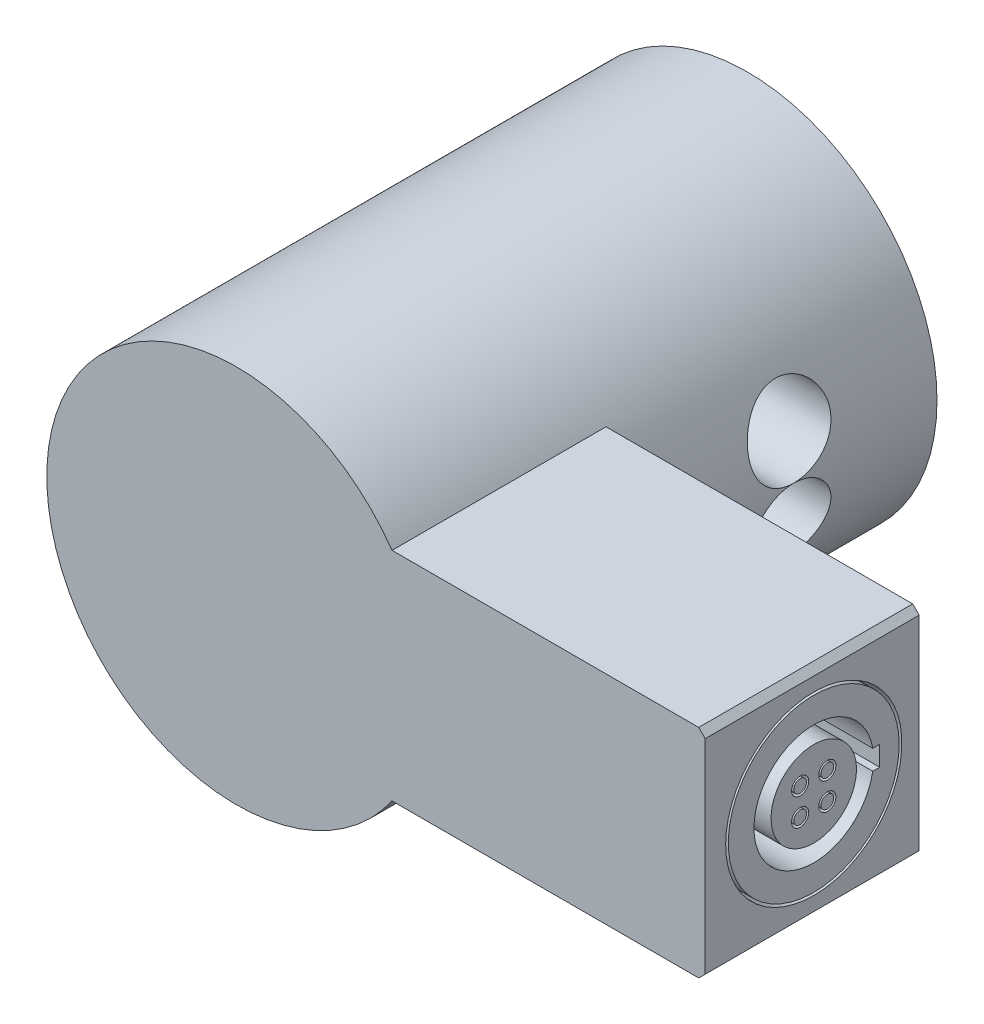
ISO-10303-21;
HEADER;
FILE_DESCRIPTION(('STEP AP214'),'2;1');
FILE_NAME('part.step','',(''),(''),'','','');
FILE_SCHEMA(('AUTOMOTIVE_DESIGN { 1 0 10303 214 1 1 1 1 }'));
ENDSEC;
DATA;
#1=APPLICATION_CONTEXT('core data for automotive mechanical design processes');
#2=APPLICATION_PROTOCOL_DEFINITION('international standard','automotive_design',2000,#1);
#3=PRODUCT_CONTEXT('',#1,'mechanical');
#4=PRODUCT('Part','Part','',(#3));
#5=PRODUCT_RELATED_PRODUCT_CATEGORY('part','',(#4));
#6=PRODUCT_DEFINITION_FORMATION('','',#4);
#7=PRODUCT_DEFINITION_CONTEXT('part definition',#1,'design');
#8=PRODUCT_DEFINITION('design','',#6,#7);
#9=PRODUCT_DEFINITION_SHAPE('','',#8);
#10=(LENGTH_UNIT() NAMED_UNIT(*) SI_UNIT(.MILLI.,.METRE.));
#11=(NAMED_UNIT(*) PLANE_ANGLE_UNIT() SI_UNIT($,.RADIAN.));
#12=(NAMED_UNIT(*) SI_UNIT($,.STERADIAN.) SOLID_ANGLE_UNIT());
#13=UNCERTAINTY_MEASURE_WITH_UNIT(LENGTH_MEASURE(1.E-05),#10,'distance_accuracy_value','');
#14=(GEOMETRIC_REPRESENTATION_CONTEXT(3) GLOBAL_UNCERTAINTY_ASSIGNED_CONTEXT((#13)) GLOBAL_UNIT_ASSIGNED_CONTEXT((#10,
#11,#12)) REPRESENTATION_CONTEXT('',''));
#15=CARTESIAN_POINT('',(0.,0.,0.));
#16=DIRECTION('',(0.,0.,1.));
#17=DIRECTION('',(1.,0.,0.));
#18=AXIS2_PLACEMENT_3D('',#15,#16,#17);
#19=CARTESIAN_POINT('',(-29.3060346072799,3.88818680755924,-32.6484514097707));
#20=DIRECTION('',(0.,0.57910812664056,0.815250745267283));
#21=DIRECTION('',(0.,-0.815250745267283,0.57910812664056));
#22=AXIS2_PLACEMENT_3D('',#19,#20,#21);
#23=PLANE('',#22);
#24=DIRECTION('',(0.,-0.815250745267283,0.57910812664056));
#25=VECTOR('',#24,1.);
#26=CARTESIAN_POINT('',(-29.3060346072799,3.88818680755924,-32.6484514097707));
#27=LINE('',#26,#25);
#28=CARTESIAN_POINT('',(-29.3060346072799,3.88818680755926,-32.6484514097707));
#29=VERTEX_POINT('',#28);
#30=CARTESIAN_POINT('',(-29.3060346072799,3.68111311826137,-32.501357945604));
#31=VERTEX_POINT('',#30);
#32=EDGE_CURVE('P0_E367',#29,#31,#27,.T.);
#33=ORIENTED_EDGE('',*,*,#32,.T.);
#34=DIRECTION('',(1.,0.,0.));
#35=VECTOR('',#34,1.);
#36=CARTESIAN_POINT('',(-29.3060346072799,3.68111311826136,-32.501357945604));
#37=LINE('',#36,#35);
#38=CARTESIAN_POINT('',(-26.2580346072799,3.68111311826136,-32.501357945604));
#39=VERTEX_POINT('',#38);
#40=EDGE_CURVE('P0_E343',#31,#39,#37,.T.);
#41=ORIENTED_EDGE('',*,*,#40,.T.);
#42=DIRECTION('',(0.,-0.815250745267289,0.579108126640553));
#43=VECTOR('',#42,1.);
#44=CARTESIAN_POINT('',(-26.2580346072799,3.88818680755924,-32.6484514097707));
#45=LINE('',#44,#43);
#46=CARTESIAN_POINT('',(-26.2580346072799,3.88818680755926,-32.6484514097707));
#47=VERTEX_POINT('',#46);
#48=EDGE_CURVE('P0_E136',#47,#39,#45,.T.);
#49=ORIENTED_EDGE('',*,*,#48,.F.);
#50=DIRECTION('',(1.,0.,0.));
#51=VECTOR('',#50,1.);
#52=CARTESIAN_POINT('',(-29.3060346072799,3.88818680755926,-32.6484514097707));
#53=LINE('',#52,#51);
#54=EDGE_CURVE('P0_E346',#29,#47,#53,.T.);
#55=ORIENTED_EDGE('',*,*,#54,.F.);
#56=EDGE_LOOP('',(#33,#41,#49,#55));
#57=FACE_BOUND('',#56,.T.);
#58=ADVANCED_FACE('P0_F16',(#57),#23,.T.);
#59=CARTESIAN_POINT('',(-25.2420346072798,6.43826500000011,-27.178));
#60=DIRECTION('',(1.,0.,0.));
#61=DIRECTION('',(0.,1.,0.));
#62=AXIS2_PLACEMENT_3D('',#59,#60,#61);
#63=PLANE('',#62);
#64=DIRECTION('',(0.,0.,-1.));
#65=VECTOR('',#64,1.);
#66=CARTESIAN_POINT('',(-25.2420346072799,6.43826500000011,-27.178));
#67=LINE('',#66,#65);
#68=CARTESIAN_POINT('',(-25.2420346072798,6.43826500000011,-27.178));
#69=VERTEX_POINT('',#68);
#70=CARTESIAN_POINT('',(-25.2420346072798,6.43826500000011,-30.353));
#71=VERTEX_POINT('',#70);
#72=EDGE_CURVE('P0_E304',#69,#71,#67,.T.);
#73=ORIENTED_EDGE('',*,*,#72,.F.);
#74=DIRECTION('',(0.,1.,0.));
#75=VECTOR('',#74,1.);
#76=CARTESIAN_POINT('',(-25.2420346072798,6.43826500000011,-27.178));
#77=LINE('',#76,#75);
#78=CARTESIAN_POINT('',(-25.2420346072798,5.14413499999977,-27.178));
#79=VERTEX_POINT('',#78);
#80=EDGE_CURVE('P0_E366',#69,#79,#77,.F.);
#81=ORIENTED_EDGE('',*,*,#80,.T.);
#82=DIRECTION('',(0.,0.,1.));
#83=VECTOR('',#82,1.);
#84=CARTESIAN_POINT('',(-25.2420346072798,5.14413499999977,-27.178));
#85=LINE('',#84,#83);
#86=CARTESIAN_POINT('',(-25.2420346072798,5.14413499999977,-30.353));
#87=VERTEX_POINT('',#86);
#88=EDGE_CURVE('P0_E284',#87,#79,#85,.T.);
#89=ORIENTED_EDGE('',*,*,#88,.F.);
#90=DIRECTION('',(0.,1.,0.));
#91=VECTOR('',#90,1.);
#92=CARTESIAN_POINT('',(-25.2420346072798,6.43826500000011,-30.353));
#93=LINE('',#92,#91);
#94=EDGE_CURVE('P0_E364',#87,#71,#93,.T.);
#95=ORIENTED_EDGE('',*,*,#94,.T.);
#96=EDGE_LOOP('',(#73,#81,#89,#95));
#97=FACE_BOUND('',#96,.T.);
#98=ADVANCED_FACE('P0_F497',(#97),#63,.T.);
#99=CARTESIAN_POINT('',(-26.2580346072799,2.60432993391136,-31.7364719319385));
#100=DIRECTION('',(1.,0.,0.));
#101=DIRECTION('',(0.,0.,-1.));
#102=AXIS2_PLACEMENT_3D('',#99,#100,#101);
#103=PLANE('',#102);
#104=DIRECTION('',(0.,-0.802249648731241,0.596988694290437));
#105=VECTOR('',#104,1.);
#106=CARTESIAN_POINT('',(-26.2580346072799,2.09051251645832,-32.9532316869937));
#107=LINE('',#106,#105);
#108=CARTESIAN_POINT('',(-26.2580346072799,-0.882363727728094,-30.7409857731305));
#109=VERTEX_POINT('',#108);
#110=CARTESIAN_POINT('',(-26.2580346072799,2.0905125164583,-32.9532316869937));
#111=VERTEX_POINT('',#110);
#112=EDGE_CURVE('P0_E342',#109,#111,#107,.F.);
#113=ORIENTED_EDGE('',*,*,#112,.F.);
#114=DIRECTION('',(0.,-0.993882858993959,0.110439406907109));
#115=VECTOR('',#114,1.);
#116=CARTESIAN_POINT('',(-26.2580346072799,-0.882363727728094,-30.7409857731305));
#117=LINE('',#116,#115);
#118=CARTESIAN_POINT('',(-26.2580346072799,-4.37398343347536,-30.353));
#119=VERTEX_POINT('',#118);
#120=EDGE_CURVE('P0_E322',#119,#109,#117,.F.);
#121=ORIENTED_EDGE('',*,*,#120,.F.);
#122=DIRECTION('',(0.,1.,0.));
#123=VECTOR('',#122,1.);
#124=CARTESIAN_POINT('',(-26.2580346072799,2.60432993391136,-30.353));
#125=LINE('',#124,#123);
#126=CARTESIAN_POINT('',(-26.2580346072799,-5.87946500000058,-30.353));
#127=VERTEX_POINT('',#126);
#128=EDGE_CURVE('P0_E371',#119,#127,#125,.F.);
#129=ORIENTED_EDGE('',*,*,#128,.T.);
#130=DIRECTION('',(0.,0.,-1.));
#131=VECTOR('',#130,1.);
#132=CARTESIAN_POINT('',(-26.2580346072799,-5.87946500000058,-31.7364719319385));
#133=LINE('',#132,#131);
#134=CARTESIAN_POINT('',(-26.2580346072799,-5.87946500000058,-30.1857121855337));
#135=VERTEX_POINT('',#134);
#136=EDGE_CURVE('P0_E378',#127,#135,#133,.F.);
#137=ORIENTED_EDGE('',*,*,#136,.T.);
#138=DIRECTION('',(0.,-0.993882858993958,0.110439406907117));
#139=VECTOR('',#138,1.);
#140=CARTESIAN_POINT('',(-26.2580346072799,-5.87946500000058,-30.1857121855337));
#141=LINE('',#140,#139);
#142=CARTESIAN_POINT('',(-26.2580346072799,-6.41413499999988,-30.1263001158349));
#143=VERTEX_POINT('',#142);
#144=EDGE_CURVE('P0_E383',#135,#143,#141,.T.);
#145=ORIENTED_EDGE('',*,*,#144,.T.);
#146=DIRECTION('',(0.,0.,-1.));
#147=VECTOR('',#146,1.);
#148=CARTESIAN_POINT('',(-26.2580346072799,-6.41413499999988,-31.7364719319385));
#149=LINE('',#148,#147);
#150=CARTESIAN_POINT('',(-26.2580346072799,-6.41413499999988,-30.353));
#151=VERTEX_POINT('',#150);
#152=EDGE_CURVE('P0_E146',#143,#151,#149,.T.);
#153=ORIENTED_EDGE('',*,*,#152,.T.);
#154=DIRECTION('',(0.,1.,0.));
#155=VECTOR('',#154,1.);
#156=CARTESIAN_POINT('',(-26.2580346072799,2.60432993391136,-30.353));
#157=LINE('',#156,#155);
#158=CARTESIAN_POINT('',(-26.2580346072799,-6.6681349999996,-30.3533195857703));
#159=VERTEX_POINT('',#158);
#160=EDGE_CURVE('P0_E360',#151,#159,#157,.F.);
#161=ORIENTED_EDGE('',*,*,#160,.T.);
#162=DIRECTION('',(0.,0.993882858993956,-0.110439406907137));
#163=VECTOR('',#162,1.);
#164=CARTESIAN_POINT('',(-26.2580346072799,-0.910415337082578,-30.9934320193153));
#165=LINE('',#164,#163);
#166=CARTESIAN_POINT('',(-26.2580346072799,-0.910415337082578,-30.9934320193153));
#167=VERTEX_POINT('',#166);
#168=EDGE_CURVE('P0_E265',#167,#159,#165,.F.);
#169=ORIENTED_EDGE('',*,*,#168,.F.);
#170=DIRECTION('',(0.,0.797724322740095,-0.603022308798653));
#171=VECTOR('',#170,1.);
#172=CARTESIAN_POINT('',(-26.2580346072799,-0.910415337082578,-30.9934320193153));
#173=LINE('',#172,#171);
#174=CARTESIAN_POINT('',(-26.2580346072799,1.99170147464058,-33.1872239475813));
#175=VERTEX_POINT('',#174);
#176=EDGE_CURVE('P0_E354',#175,#167,#173,.F.);
#177=ORIENTED_EDGE('',*,*,#176,.F.);
#178=CARTESIAN_POINT('',(-26.2580346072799,2.60432993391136,-31.7364719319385));
#179=DIRECTION('',(1.,0.,0.));
#180=DIRECTION('',(0.,1.,0.));
#181=AXIS2_PLACEMENT_3D('',#178,#179,#180);
#182=CIRCLE('',#181,1.5748);
#183=EDGE_CURVE('P0_E19',#47,#175,#182,.F.);
#184=ORIENTED_EDGE('',*,*,#183,.F.);
#185=ORIENTED_EDGE('',*,*,#48,.T.);
#186=CARTESIAN_POINT('',(-26.2580346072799,2.60432993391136,-31.7364719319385));
#187=DIRECTION('',(1.,0.,0.));
#188=DIRECTION('',(0.,1.,0.));
#189=AXIS2_PLACEMENT_3D('',#186,#187,#188);
#190=CIRCLE('',#189,1.3208);
#191=EDGE_CURVE('P0_E345',#39,#111,#190,.F.);
#192=ORIENTED_EDGE('',*,*,#191,.T.);
#193=EDGE_LOOP('',(#113,#121,#129,#137,#145,#153,#161,#169,#177,#184,#185,#192));
#194=FACE_BOUND('',#193,.T.);
#195=ADVANCED_FACE('P0_F414',(#194),#103,.T.);
#196=CARTESIAN_POINT('',(-29.3060346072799,-0.910415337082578,-30.9934320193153));
#197=DIRECTION('',(0.,-0.603022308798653,-0.797724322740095));
#198=DIRECTION('',(0.,0.797724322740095,-0.603022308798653));
#199=AXIS2_PLACEMENT_3D('',#196,#197,#198);
#200=PLANE('',#199);
#201=DIRECTION('',(0.,0.797724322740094,-0.603022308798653));
#202=VECTOR('',#201,1.);
#203=CARTESIAN_POINT('',(-29.3060346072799,-0.910415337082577,-30.9934320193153));
#204=LINE('',#203,#202);
#205=CARTESIAN_POINT('',(-29.3060346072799,-0.910415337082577,-30.9934320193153));
#206=VERTEX_POINT('',#205);
#207=CARTESIAN_POINT('',(-29.3060346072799,1.99170147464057,-33.1872239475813));
#208=VERTEX_POINT('',#207);
#209=EDGE_CURVE('P0_E240',#206,#208,#204,.T.);
#210=ORIENTED_EDGE('',*,*,#209,.T.);
#211=DIRECTION('',(1.,0.,0.));
#212=VECTOR('',#211,1.);
#213=CARTESIAN_POINT('',(-29.3060346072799,1.99170147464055,-33.1872239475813));
#214=LINE('',#213,#212);
#215=EDGE_CURVE('P0_E347',#175,#208,#214,.F.);
#216=ORIENTED_EDGE('',*,*,#215,.F.);
#217=ORIENTED_EDGE('',*,*,#176,.T.);
#218=DIRECTION('',(1.,0.,0.));
#219=VECTOR('',#218,1.);
#220=CARTESIAN_POINT('',(-29.3060346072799,-0.910415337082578,-30.9934320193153));
#221=LINE('',#220,#219);
#222=EDGE_CURVE('P0_E250',#206,#167,#221,.T.);
#223=ORIENTED_EDGE('',*,*,#222,.F.);
#224=EDGE_LOOP('',(#210,#216,#217,#223));
#225=FACE_BOUND('',#224,.T.);
#226=ADVANCED_FACE('P0_F449',(#225),#200,.T.);
#227=CARTESIAN_POINT('',(-29.3060346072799,2.60432993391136,-31.7364719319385));
#228=DIRECTION('',(1.,0.,0.));
#229=DIRECTION('',(0.,1.,0.));
#230=AXIS2_PLACEMENT_3D('',#227,#228,#229);
#231=CYLINDRICAL_SURFACE('',#230,1.5748);
#232=CARTESIAN_POINT('',(-29.3060346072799,2.60432993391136,-31.7364719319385));
#233=DIRECTION('',(1.,0.,0.));
#234=DIRECTION('',(0.,1.,0.));
#235=AXIS2_PLACEMENT_3D('',#232,#233,#234);
#236=CIRCLE('',#235,1.5748);
#237=EDGE_CURVE('P0_E243',#208,#29,#236,.T.);
#238=ORIENTED_EDGE('',*,*,#237,.T.);
#239=ORIENTED_EDGE('',*,*,#54,.T.);
#240=ORIENTED_EDGE('',*,*,#183,.T.);
#241=ORIENTED_EDGE('',*,*,#215,.T.);
#242=EDGE_LOOP('',(#238,#239,#240,#241));
#243=FACE_BOUND('',#242,.T.);
#244=ADVANCED_FACE('P0_F543',(#243),#231,.T.);
#245=CARTESIAN_POINT('',(-29.3060346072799,2.60432993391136,-31.7364719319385));
#246=DIRECTION('',(1.,0.,0.));
#247=DIRECTION('',(0.,1.,0.));
#248=AXIS2_PLACEMENT_3D('',#245,#246,#247);
#249=CYLINDRICAL_SURFACE('',#248,1.3208);
#250=ORIENTED_EDGE('',*,*,#40,.F.);
#251=CARTESIAN_POINT('',(-29.3060346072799,2.60432993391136,-31.7364719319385));
#252=DIRECTION('',(1.,0.,0.));
#253=DIRECTION('',(0.,1.,0.));
#254=AXIS2_PLACEMENT_3D('',#251,#252,#253);
#255=CIRCLE('',#254,1.3208);
#256=CARTESIAN_POINT('',(-29.3060346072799,2.0905125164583,-32.9532316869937));
#257=VERTEX_POINT('',#256);
#258=EDGE_CURVE('P0_E237',#31,#257,#255,.F.);
#259=ORIENTED_EDGE('',*,*,#258,.T.);
#260=DIRECTION('',(1.,0.,0.));
#261=VECTOR('',#260,1.);
#262=CARTESIAN_POINT('',(-29.3060346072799,2.09051251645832,-32.9532316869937));
#263=LINE('',#262,#261);
#264=EDGE_CURVE('P0_E331',#111,#257,#263,.F.);
#265=ORIENTED_EDGE('',*,*,#264,.F.);
#266=ORIENTED_EDGE('',*,*,#191,.F.);
#267=EDGE_LOOP('',(#250,#259,#265,#266));
#268=FACE_BOUND('',#267,.T.);
#269=ADVANCED_FACE('P0_F420',(#268),#249,.F.);
#270=CARTESIAN_POINT('',(-29.3060346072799,2.09051251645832,-32.9532316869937));
#271=DIRECTION('',(0.,0.596988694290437,0.802249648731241));
#272=DIRECTION('',(0.,-0.802249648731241,0.596988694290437));
#273=AXIS2_PLACEMENT_3D('',#270,#271,#272);
#274=PLANE('',#273);
#275=DIRECTION('',(0.,-0.802249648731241,0.596988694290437));
#276=VECTOR('',#275,1.);
#277=CARTESIAN_POINT('',(-29.3060346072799,2.09051251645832,-32.9532316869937));
#278=LINE('',#277,#276);
#279=CARTESIAN_POINT('',(-29.3060346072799,-0.882363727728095,-30.7409857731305));
#280=VERTEX_POINT('',#279);
#281=EDGE_CURVE('P0_E233',#257,#280,#278,.T.);
#282=ORIENTED_EDGE('',*,*,#281,.T.);
#283=DIRECTION('',(1.,0.,0.));
#284=VECTOR('',#283,1.);
#285=CARTESIAN_POINT('',(-29.3060346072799,-0.882363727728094,-30.7409857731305));
#286=LINE('',#285,#284);
#287=EDGE_CURVE('P0_E325',#109,#280,#286,.F.);
#288=ORIENTED_EDGE('',*,*,#287,.F.);
#289=ORIENTED_EDGE('',*,*,#112,.T.);
#290=ORIENTED_EDGE('',*,*,#264,.T.);
#291=EDGE_LOOP('',(#282,#288,#289,#290));
#292=FACE_BOUND('',#291,.T.);
#293=ADVANCED_FACE('P0_F424',(#292),#274,.T.);
#294=CARTESIAN_POINT('',(-25.2420346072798,5.14413499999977,-27.178));
#295=DIRECTION('',(-1.,0.,0.));
#296=DIRECTION('',(0.,-1.,0.));
#297=AXIS2_PLACEMENT_3D('',#294,#295,#296);
#298=PLANE('',#297);
#299=DIRECTION('',(0.,0.,-1.));
#300=VECTOR('',#299,1.);
#301=CARTESIAN_POINT('',(-25.2420346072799,-6.03313499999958,-27.178));
#302=LINE('',#301,#300);
#303=CARTESIAN_POINT('',(-25.2420346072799,-6.03313499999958,-30.353));
#304=VERTEX_POINT('',#303);
#305=CARTESIAN_POINT('',(-25.2420346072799,-6.03313499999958,-27.178));
#306=VERTEX_POINT('',#305);
#307=EDGE_CURVE('P0_E298',#304,#306,#302,.F.);
#308=ORIENTED_EDGE('',*,*,#307,.T.);
#309=DIRECTION('',(0.,-1.,0.));
#310=VECTOR('',#309,1.);
#311=CARTESIAN_POINT('',(-25.2420346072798,5.14413499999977,-27.178));
#312=LINE('',#311,#310);
#313=CARTESIAN_POINT('',(-25.2420346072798,-5.49846500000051,-27.178));
#314=VERTEX_POINT('',#313);
#315=EDGE_CURVE('P0_E326',#306,#314,#312,.F.);
#316=ORIENTED_EDGE('',*,*,#315,.T.);
#317=DIRECTION('',(0.,0.,-1.));
#318=VECTOR('',#317,1.);
#319=CARTESIAN_POINT('',(-25.2420346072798,-5.49846500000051,-27.178));
#320=LINE('',#319,#318);
#321=CARTESIAN_POINT('',(-25.2420346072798,-5.49846500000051,-30.353));
#322=VERTEX_POINT('',#321);
#323=EDGE_CURVE('P0_E261',#322,#314,#320,.F.);
#324=ORIENTED_EDGE('',*,*,#323,.F.);
#325=DIRECTION('',(0.,-1.,0.));
#326=VECTOR('',#325,1.);
#327=CARTESIAN_POINT('',(-25.2420346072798,5.14413499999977,-30.353));
#328=LINE('',#327,#326);
#329=EDGE_CURVE('P0_E329',#322,#304,#328,.T.);
#330=ORIENTED_EDGE('',*,*,#329,.T.);
#331=EDGE_LOOP('',(#308,#316,#324,#330));
#332=FACE_BOUND('',#331,.T.);
#333=ADVANCED_FACE('P0_F601',(#332),#298,.T.);
#334=CARTESIAN_POINT('',(-29.3060346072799,-0.882363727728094,-30.7409857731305));
#335=DIRECTION('',(0.,0.110439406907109,0.993882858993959));
#336=DIRECTION('',(0.,-0.993882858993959,0.110439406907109));
#337=AXIS2_PLACEMENT_3D('',#334,#335,#336);
#338=PLANE('',#337);
#339=ORIENTED_EDGE('',*,*,#120,.T.);
#340=ORIENTED_EDGE('',*,*,#287,.T.);
#341=DIRECTION('',(0.,-0.993882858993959,0.110439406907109));
#342=VECTOR('',#341,1.);
#343=CARTESIAN_POINT('',(-29.3060346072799,-0.882363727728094,-30.7409857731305));
#344=LINE('',#343,#342);
#345=CARTESIAN_POINT('',(-29.3060346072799,-4.37398343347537,-30.353));
#346=VERTEX_POINT('',#345);
#347=EDGE_CURVE('P0_E236',#280,#346,#344,.T.);
#348=ORIENTED_EDGE('',*,*,#347,.T.);
#349=DIRECTION('',(1.,0.,0.));
#350=VECTOR('',#349,1.);
#351=CARTESIAN_POINT('',(-29.9410346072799,-4.37398343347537,-30.353));
#352=LINE('',#351,#350);
#353=EDGE_CURVE('P0_E224',#119,#346,#352,.F.);
#354=ORIENTED_EDGE('',*,*,#353,.F.);
#355=EDGE_LOOP('',(#339,#340,#348,#354));
#356=FACE_BOUND('',#355,.T.);
#357=ADVANCED_FACE('P0_F433',(#356),#338,.T.);
#358=CARTESIAN_POINT('',(-25.6230346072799,6.43826500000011,-27.178));
#359=DIRECTION('',(0.,0.,-1.));
#360=DIRECTION('',(-1.,0.,0.));
#361=AXIS2_PLACEMENT_3D('',#358,#359,#360);
#362=CYLINDRICAL_SURFACE('',#361,0.38100000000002);
#363=CARTESIAN_POINT('',(-25.6230346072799,6.43826500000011,-27.178));
#364=DIRECTION('',(0.,0.,-1.));
#365=DIRECTION('',(-1.,0.,0.));
#366=AXIS2_PLACEMENT_3D('',#363,#364,#365);
#367=CIRCLE('',#366,0.38100000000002);
#368=CARTESIAN_POINT('',(-25.6230346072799,6.81926500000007,-27.178));
#369=VERTEX_POINT('',#368);
#370=EDGE_CURVE('P0_E309',#369,#69,#367,.T.);
#371=ORIENTED_EDGE('',*,*,#370,.T.);
#372=ORIENTED_EDGE('',*,*,#72,.T.);
#373=CARTESIAN_POINT('',(-25.6230346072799,6.43826500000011,-30.353));
#374=DIRECTION('',(0.,0.,-1.));
#375=DIRECTION('',(-1.,0.,0.));
#376=AXIS2_PLACEMENT_3D('',#373,#374,#375);
#377=CIRCLE('',#376,0.38100000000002);
#378=CARTESIAN_POINT('',(-25.6230346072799,6.819265,-30.353));
#379=VERTEX_POINT('',#378);
#380=EDGE_CURVE('P0_E223',#379,#71,#377,.T.);
#381=ORIENTED_EDGE('',*,*,#380,.F.);
#382=DIRECTION('',(0.,0.,1.));
#383=VECTOR('',#382,1.);
#384=CARTESIAN_POINT('',(-25.6230346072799,6.819265,-27.178));
#385=LINE('',#384,#383);
#386=EDGE_CURVE('P0_E206',#369,#379,#385,.F.);
#387=ORIENTED_EDGE('',*,*,#386,.F.);
#388=EDGE_LOOP('',(#371,#372,#381,#387));
#389=FACE_BOUND('',#388,.T.);
#390=ADVANCED_FACE('P0_F493',(#389),#362,.T.);
#391=CARTESIAN_POINT('',(-25.2420346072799,5.14413499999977,-27.178));
#392=DIRECTION('',(0.,1.,0.));
#393=DIRECTION('',(-1.,0.,0.));
#394=AXIS2_PLACEMENT_3D('',#391,#392,#393);
#395=PLANE('',#394);
#396=DIRECTION('',(-1.,0.,0.));
#397=VECTOR('',#396,1.);
#398=CARTESIAN_POINT('',(-25.2420346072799,5.14413499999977,-27.178));
#399=LINE('',#398,#397);
#400=CARTESIAN_POINT('',(-24.9880346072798,5.14413499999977,-27.178));
#401=VERTEX_POINT('',#400);
#402=EDGE_CURVE('P0_E281',#79,#401,#399,.F.);
#403=ORIENTED_EDGE('',*,*,#402,.T.);
#404=DIRECTION('',(0.,0.,1.));
#405=VECTOR('',#404,1.);
#406=CARTESIAN_POINT('',(-24.9880346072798,5.14413499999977,-27.178));
#407=LINE('',#406,#405);
#408=CARTESIAN_POINT('',(-24.9880346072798,5.14413499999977,-30.353));
#409=VERTEX_POINT('',#408);
#410=EDGE_CURVE('P0_E278',#409,#401,#407,.T.);
#411=ORIENTED_EDGE('',*,*,#410,.F.);
#412=DIRECTION('',(1.,0.,0.));
#413=VECTOR('',#412,1.);
#414=CARTESIAN_POINT('',(-29.9410346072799,5.14413499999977,-30.353));
#415=LINE('',#414,#413);
#416=EDGE_CURVE('P0_E287',#87,#409,#415,.T.);
#417=ORIENTED_EDGE('',*,*,#416,.F.);
#418=ORIENTED_EDGE('',*,*,#88,.T.);
#419=EDGE_LOOP('',(#403,#411,#417,#418));
#420=FACE_BOUND('',#419,.T.);
#421=ADVANCED_FACE('P0_F502',(#420),#395,.T.);
#422=CARTESIAN_POINT('',(-25.6230346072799,-6.03313499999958,-27.178));
#423=DIRECTION('',(0.,0.,-1.));
#424=DIRECTION('',(-1.,0.,0.));
#425=AXIS2_PLACEMENT_3D('',#422,#423,#424);
#426=CYLINDRICAL_SURFACE('',#425,0.634999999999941);
#427=CARTESIAN_POINT('',(-25.6230346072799,-6.03313499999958,-27.178));
#428=DIRECTION('',(0.,0.,-1.));
#429=DIRECTION('',(-1.,0.,0.));
#430=AXIS2_PLACEMENT_3D('',#427,#428,#429);
#431=CIRCLE('',#430,0.634999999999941);
#432=CARTESIAN_POINT('',(-24.9880346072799,-6.03313499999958,-27.178));
#433=VERTEX_POINT('',#432);
#434=CARTESIAN_POINT('',(-25.6230346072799,-6.66813499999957,-27.178));
#435=VERTEX_POINT('',#434);
#436=EDGE_CURVE('P0_E268',#433,#435,#431,.T.);
#437=ORIENTED_EDGE('',*,*,#436,.T.);
#438=DIRECTION('',(0.,0.,1.));
#439=VECTOR('',#438,1.);
#440=CARTESIAN_POINT('',(-25.6230346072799,-6.66813499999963,-27.178));
#441=LINE('',#440,#439);
#442=CARTESIAN_POINT('',(-25.6230346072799,-6.66813499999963,-30.353));
#443=VERTEX_POINT('',#442);
#444=EDGE_CURVE('P0_E465',#443,#435,#441,.T.);
#445=ORIENTED_EDGE('',*,*,#444,.F.);
#446=CARTESIAN_POINT('',(-25.6230346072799,-6.03313499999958,-30.353));
#447=DIRECTION('',(0.,0.,-1.));
#448=DIRECTION('',(-1.,0.,0.));
#449=AXIS2_PLACEMENT_3D('',#446,#447,#448);
#450=CIRCLE('',#449,0.634999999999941);
#451=CARTESIAN_POINT('',(-24.9880346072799,-6.03313499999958,-30.353));
#452=VERTEX_POINT('',#451);
#453=EDGE_CURVE('P0_E290',#452,#443,#450,.T.);
#454=ORIENTED_EDGE('',*,*,#453,.F.);
#455=DIRECTION('',(0.,0.,1.));
#456=VECTOR('',#455,1.);
#457=CARTESIAN_POINT('',(-24.9880346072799,-6.03313499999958,-27.178));
#458=LINE('',#457,#456);
#459=EDGE_CURVE('P0_E466',#433,#452,#458,.F.);
#460=ORIENTED_EDGE('',*,*,#459,.F.);
#461=EDGE_LOOP('',(#437,#445,#454,#460));
#462=FACE_BOUND('',#461,.T.);
#463=ADVANCED_FACE('P0_F511',(#462),#426,.T.);
#464=CARTESIAN_POINT('',(-29.3060346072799,-0.910415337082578,-30.9934320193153));
#465=DIRECTION('',(0.,-0.110439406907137,-0.993882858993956));
#466=DIRECTION('',(0.,0.993882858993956,-0.110439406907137));
#467=AXIS2_PLACEMENT_3D('',#464,#465,#466);
#468=PLANE('',#467);
#469=DIRECTION('',(0.,0.993882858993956,-0.110439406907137));
#470=VECTOR('',#469,1.);
#471=CARTESIAN_POINT('',(-29.3060346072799,-6.66813499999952,-30.3536391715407));
#472=LINE('',#471,#470);
#473=CARTESIAN_POINT('',(-29.3060346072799,-6.66813499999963,-30.3536391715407));
#474=VERTEX_POINT('',#473);
#475=EDGE_CURVE('P0_E244',#474,#206,#472,.T.);
#476=ORIENTED_EDGE('',*,*,#475,.T.);
#477=ORIENTED_EDGE('',*,*,#222,.T.);
#478=ORIENTED_EDGE('',*,*,#168,.T.);
#479=DIRECTION('',(1.,0.,0.));
#480=VECTOR('',#479,1.);
#481=CARTESIAN_POINT('',(-26.2580346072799,-6.66813499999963,-30.3536391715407));
#482=LINE('',#481,#480);
#483=EDGE_CURVE('P0_E230',#474,#159,#482,.T.);
#484=ORIENTED_EDGE('',*,*,#483,.F.);
#485=EDGE_LOOP('',(#476,#477,#478,#484));
#486=FACE_BOUND('',#485,.T.);
#487=ADVANCED_FACE('P0_F453',(#486),#468,.T.);
#488=CARTESIAN_POINT('',(-29.3060346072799,2.60432993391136,-31.7364719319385));
#489=DIRECTION('',(1.,0.,0.));
#490=DIRECTION('',(0.,0.,-1.));
#491=AXIS2_PLACEMENT_3D('',#488,#489,#490);
#492=PLANE('',#491);
#493=DIRECTION('',(0.,1.,0.));
#494=VECTOR('',#493,1.);
#495=CARTESIAN_POINT('',(-29.3060346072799,6.43826500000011,-30.353));
#496=LINE('',#495,#494);
#497=CARTESIAN_POINT('',(-29.3060346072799,-5.87946500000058,-30.353));
#498=VERTEX_POINT('',#497);
#499=EDGE_CURVE('P0_E220',#346,#498,#496,.F.);
#500=ORIENTED_EDGE('',*,*,#499,.F.);
#501=ORIENTED_EDGE('',*,*,#347,.F.);
#502=ORIENTED_EDGE('',*,*,#281,.F.);
#503=ORIENTED_EDGE('',*,*,#258,.F.);
#504=ORIENTED_EDGE('',*,*,#32,.F.);
#505=ORIENTED_EDGE('',*,*,#237,.F.);
#506=ORIENTED_EDGE('',*,*,#209,.F.);
#507=ORIENTED_EDGE('',*,*,#475,.F.);
#508=DIRECTION('',(0.,0.,1.));
#509=VECTOR('',#508,1.);
#510=CARTESIAN_POINT('',(-29.3060346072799,-6.66813499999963,-27.178));
#511=LINE('',#510,#509);
#512=CARTESIAN_POINT('',(-29.3060346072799,-6.66813499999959,-27.178));
#513=VERTEX_POINT('',#512);
#514=EDGE_CURVE('P0_E468',#513,#474,#511,.F.);
#515=ORIENTED_EDGE('',*,*,#514,.F.);
#516=DIRECTION('',(0.,1.,0.));
#517=VECTOR('',#516,1.);
#518=CARTESIAN_POINT('',(-29.3060346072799,2.60432993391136,-27.178));
#519=LINE('',#518,#517);
#520=CARTESIAN_POINT('',(-29.3060346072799,-6.41413500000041,-27.178));
#521=VERTEX_POINT('',#520);
#522=EDGE_CURVE('P0_E247',#521,#513,#519,.F.);
#523=ORIENTED_EDGE('',*,*,#522,.F.);
#524=DIRECTION('',(0.,0.,1.));
#525=VECTOR('',#524,1.);
#526=CARTESIAN_POINT('',(-29.3060346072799,-6.41413500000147,-27.178));
#527=LINE('',#526,#525);
#528=CARTESIAN_POINT('',(-29.3060346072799,-6.41413500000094,-30.1263001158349));
#529=VERTEX_POINT('',#528);
#530=EDGE_CURVE('P0_E255',#529,#521,#527,.T.);
#531=ORIENTED_EDGE('',*,*,#530,.F.);
#532=DIRECTION('',(0.,-0.993882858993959,0.110439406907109));
#533=VECTOR('',#532,1.);
#534=CARTESIAN_POINT('',(-29.3060346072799,-0.882363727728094,-30.7409857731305));
#535=LINE('',#534,#533);
#536=CARTESIAN_POINT('',(-29.3060346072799,-5.87946500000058,-30.1857121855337));
#537=VERTEX_POINT('',#536);
#538=EDGE_CURVE('P0_E258',#537,#529,#535,.T.);
#539=ORIENTED_EDGE('',*,*,#538,.F.);
#540=DIRECTION('',(0.,0.,-1.));
#541=VECTOR('',#540,1.);
#542=CARTESIAN_POINT('',(-29.3060346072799,-5.87946500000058,-31.7364719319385));
#543=LINE('',#542,#541);
#544=EDGE_CURVE('P0_E301',#498,#537,#543,.F.);
#545=ORIENTED_EDGE('',*,*,#544,.F.);
#546=EDGE_LOOP('',(#500,#501,#502,#503,#504,#505,#506,#507,#515,#523,#531,#539,#545));
#547=FACE_BOUND('',#546,.T.);
#548=ADVANCED_FACE('P0_F428',(#547),#492,.F.);
#549=CARTESIAN_POINT('',(-25.6230346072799,-6.03313499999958,-27.178));
#550=DIRECTION('',(0.,0.,-1.));
#551=DIRECTION('',(-1.,0.,0.));
#552=AXIS2_PLACEMENT_3D('',#549,#550,#551);
#553=CYLINDRICAL_SURFACE('',#552,0.380999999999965);
#554=DIRECTION('',(0.,0.,1.));
#555=VECTOR('',#554,1.);
#556=CARTESIAN_POINT('',(-25.6230346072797,-6.41413499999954,-27.178));
#557=LINE('',#556,#555);
#558=CARTESIAN_POINT('',(-25.6230346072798,-6.41413499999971,-27.178));
#559=VERTEX_POINT('',#558);
#560=CARTESIAN_POINT('',(-25.6230346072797,-6.41413499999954,-30.353));
#561=VERTEX_POINT('',#560);
#562=EDGE_CURVE('P0_E212',#559,#561,#557,.F.);
#563=ORIENTED_EDGE('',*,*,#562,.F.);
#564=CARTESIAN_POINT('',(-25.6230346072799,-6.03313499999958,-27.178));
#565=DIRECTION('',(0.,0.,-1.));
#566=DIRECTION('',(-1.,0.,0.));
#567=AXIS2_PLACEMENT_3D('',#564,#565,#566);
#568=CIRCLE('',#567,0.380999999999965);
#569=EDGE_CURVE('P0_E262',#306,#559,#568,.T.);
#570=ORIENTED_EDGE('',*,*,#569,.F.);
#571=ORIENTED_EDGE('',*,*,#307,.F.);
#572=CARTESIAN_POINT('',(-25.6230346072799,-6.03313499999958,-30.353));
#573=DIRECTION('',(0.,0.,-1.));
#574=DIRECTION('',(-1.,0.,0.));
#575=AXIS2_PLACEMENT_3D('',#572,#573,#574);
#576=CIRCLE('',#575,0.380999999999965);
#577=EDGE_CURVE('P0_E397',#561,#304,#576,.F.);
#578=ORIENTED_EDGE('',*,*,#577,.F.);
#579=EDGE_LOOP('',(#563,#570,#571,#578));
#580=FACE_BOUND('',#579,.T.);
#581=ADVANCED_FACE('P0_F584',(#580),#553,.F.);
#582=CARTESIAN_POINT('',(-29.3060346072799,-0.882363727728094,-30.7409857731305));
#583=DIRECTION('',(0.,0.110439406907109,0.993882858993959));
#584=DIRECTION('',(0.,-0.993882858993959,0.110439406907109));
#585=AXIS2_PLACEMENT_3D('',#582,#583,#584);
#586=PLANE('',#585);
#587=ORIENTED_EDGE('',*,*,#538,.T.);
#588=DIRECTION('',(-1.,-5.24521753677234E-13,0.));
#589=VECTOR('',#588,1.);
#590=CARTESIAN_POINT('',(-26.2580346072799,-6.41413499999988,-30.1263001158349));
#591=LINE('',#590,#589);
#592=EDGE_CURVE('P0_E229',#143,#529,#591,.T.);
#593=ORIENTED_EDGE('',*,*,#592,.F.);
#594=ORIENTED_EDGE('',*,*,#144,.F.);
#595=DIRECTION('',(1.,0.,0.));
#596=VECTOR('',#595,1.);
#597=CARTESIAN_POINT('',(-29.9410346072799,-5.87946500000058,-30.1857121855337));
#598=LINE('',#597,#596);
#599=EDGE_CURVE('P0_E211',#537,#135,#598,.T.);
#600=ORIENTED_EDGE('',*,*,#599,.F.);
#601=EDGE_LOOP('',(#587,#593,#594,#600));
#602=FACE_BOUND('',#601,.T.);
#603=ADVANCED_FACE('P0_F580',(#602),#586,.T.);
#604=CARTESIAN_POINT('',(-25.6230346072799,-5.49846500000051,-27.178));
#605=DIRECTION('',(0.,0.,-1.));
#606=DIRECTION('',(-1.,0.,0.));
#607=AXIS2_PLACEMENT_3D('',#604,#605,#606);
#608=CYLINDRICAL_SURFACE('',#607,0.381000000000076);
#609=CARTESIAN_POINT('',(-25.6230346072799,-5.49846500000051,-27.178));
#610=DIRECTION('',(0.,0.,-1.));
#611=DIRECTION('',(-1.,0.,0.));
#612=AXIS2_PLACEMENT_3D('',#609,#610,#611);
#613=CIRCLE('',#612,0.381000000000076);
#614=CARTESIAN_POINT('',(-25.6230346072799,-5.87946500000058,-27.178));
#615=VERTEX_POINT('',#614);
#616=EDGE_CURVE('P0_E297',#314,#615,#613,.T.);
#617=ORIENTED_EDGE('',*,*,#616,.T.);
#618=DIRECTION('',(0.,0.,1.));
#619=VECTOR('',#618,1.);
#620=CARTESIAN_POINT('',(-25.6230346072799,-5.87946500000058,-27.178));
#621=LINE('',#620,#619);
#622=CARTESIAN_POINT('',(-25.6230346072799,-5.87946500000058,-30.353));
#623=VERTEX_POINT('',#622);
#624=EDGE_CURVE('P0_E202',#623,#615,#621,.T.);
#625=ORIENTED_EDGE('',*,*,#624,.F.);
#626=CARTESIAN_POINT('',(-25.6230346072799,-5.49846500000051,-30.353));
#627=DIRECTION('',(0.,0.,-1.));
#628=DIRECTION('',(-1.,0.,0.));
#629=AXIS2_PLACEMENT_3D('',#626,#627,#628);
#630=CIRCLE('',#629,0.381000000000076);
#631=EDGE_CURVE('P0_E395',#322,#623,#630,.T.);
#632=ORIENTED_EDGE('',*,*,#631,.F.);
#633=ORIENTED_EDGE('',*,*,#323,.T.);
#634=EDGE_LOOP('',(#617,#625,#632,#633));
#635=FACE_BOUND('',#634,.T.);
#636=ADVANCED_FACE('P0_F577',(#635),#608,.T.);
#637=CARTESIAN_POINT('',(-29.9410346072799,6.43826500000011,-30.353));
#638=DIRECTION('',(0.,0.,-1.));
#639=DIRECTION('',(0.,1.,0.));
#640=AXIS2_PLACEMENT_3D('',#637,#638,#639);
#641=PLANE('',#640);
#642=DIRECTION('',(1.,0.,0.));
#643=VECTOR('',#642,1.);
#644=CARTESIAN_POINT('',(-29.9410346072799,-5.87946500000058,-30.353));
#645=LINE('',#644,#643);
#646=EDGE_CURVE('P0_E215',#127,#623,#645,.T.);
#647=ORIENTED_EDGE('',*,*,#646,.F.);
#648=ORIENTED_EDGE('',*,*,#128,.F.);
#649=ORIENTED_EDGE('',*,*,#353,.T.);
#650=ORIENTED_EDGE('',*,*,#499,.T.);
#651=DIRECTION('',(1.,0.,0.));
#652=VECTOR('',#651,1.);
#653=CARTESIAN_POINT('',(-29.9410346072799,-5.87946500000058,-30.353));
#654=LINE('',#653,#652);
#655=CARTESIAN_POINT('',(-29.9410346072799,-5.87946500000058,-30.353));
#656=VERTEX_POINT('',#655);
#657=EDGE_CURVE('P0_E208',#656,#498,#654,.T.);
#658=ORIENTED_EDGE('',*,*,#657,.F.);
#659=CARTESIAN_POINT('',(-29.9410346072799,-5.49846500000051,-30.353));
#660=DIRECTION('',(0.,0.,-1.));
#661=DIRECTION('',(-1.,0.,0.));
#662=AXIS2_PLACEMENT_3D('',#659,#660,#661);
#663=CIRCLE('',#662,0.381000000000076);
#664=CARTESIAN_POINT('',(-30.32203460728,-5.49846500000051,-30.353));
#665=VERTEX_POINT('',#664);
#666=EDGE_CURVE('P0_E197',#665,#656,#663,.F.);
#667=ORIENTED_EDGE('',*,*,#666,.F.);
#668=DIRECTION('',(0.,1.,0.));
#669=VECTOR('',#668,1.);
#670=CARTESIAN_POINT('',(-30.32203460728,6.43826500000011,-30.353));
#671=LINE('',#670,#669);
#672=CARTESIAN_POINT('',(-30.32203460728,6.43826500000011,-30.353));
#673=VERTEX_POINT('',#672);
#674=EDGE_CURVE('P0_E188',#673,#665,#671,.F.);
#675=ORIENTED_EDGE('',*,*,#674,.F.);
#676=CARTESIAN_POINT('',(-29.9410346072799,6.43826500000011,-30.353));
#677=DIRECTION('',(0.,0.,-1.));
#678=DIRECTION('',(-1.,0.,0.));
#679=AXIS2_PLACEMENT_3D('',#676,#677,#678);
#680=CIRCLE('',#679,0.38100000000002);
#681=CARTESIAN_POINT('',(-29.9410346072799,6.819265,-30.353));
#682=VERTEX_POINT('',#681);
#683=EDGE_CURVE('P0_E175',#682,#673,#680,.F.);
#684=ORIENTED_EDGE('',*,*,#683,.F.);
#685=DIRECTION('',(-1.,0.,0.));
#686=VECTOR('',#685,1.);
#687=CARTESIAN_POINT('',(-29.9410346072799,6.819265,-30.353));
#688=LINE('',#687,#686);
#689=EDGE_CURVE('P0_E293',#379,#682,#688,.T.);
#690=ORIENTED_EDGE('',*,*,#689,.F.);
#691=ORIENTED_EDGE('',*,*,#380,.T.);
#692=ORIENTED_EDGE('',*,*,#94,.F.);
#693=ORIENTED_EDGE('',*,*,#416,.T.);
#694=DIRECTION('',(0.,1.,0.));
#695=VECTOR('',#694,1.);
#696=CARTESIAN_POINT('',(-24.9880346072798,5.14413499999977,-30.353));
#697=LINE('',#696,#695);
#698=EDGE_CURVE('P0_E275',#452,#409,#697,.T.);
#699=ORIENTED_EDGE('',*,*,#698,.F.);
#700=ORIENTED_EDGE('',*,*,#453,.T.);
#701=DIRECTION('',(1.,0.,0.));
#702=VECTOR('',#701,1.);
#703=CARTESIAN_POINT('',(-26.2580346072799,-6.66813499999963,-30.353));
#704=LINE('',#703,#702);
#705=EDGE_CURVE('P0_E460',#159,#443,#704,.T.);
#706=ORIENTED_EDGE('',*,*,#705,.F.);
#707=ORIENTED_EDGE('',*,*,#160,.F.);
#708=DIRECTION('',(-1.,-5.24521753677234E-13,0.));
#709=VECTOR('',#708,1.);
#710=CARTESIAN_POINT('',(-26.2580346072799,-6.41413499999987,-30.353));
#711=LINE('',#710,#709);
#712=EDGE_CURVE('P0_E227',#561,#151,#711,.T.);
#713=ORIENTED_EDGE('',*,*,#712,.F.);
#714=ORIENTED_EDGE('',*,*,#577,.T.);
#715=ORIENTED_EDGE('',*,*,#329,.F.);
#716=ORIENTED_EDGE('',*,*,#631,.T.);
#717=EDGE_LOOP('',(#647,#648,#649,#650,#658,#667,#675,#684,#690,#691,#692,#693,#699,#700,#706,
#707,#713,#714,#715,#716));
#718=FACE_BOUND('',#717,.T.);
#719=ADVANCED_FACE('P0_F195',(#718),#641,.T.);
#720=CARTESIAN_POINT('',(-29.9410346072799,-5.49846500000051,-27.178));
#721=DIRECTION('',(0.,0.,-1.));
#722=DIRECTION('',(-1.,0.,0.));
#723=AXIS2_PLACEMENT_3D('',#720,#721,#722);
#724=CYLINDRICAL_SURFACE('',#723,0.381000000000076);
#725=CARTESIAN_POINT('',(-29.9410346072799,-5.49846500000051,-27.178));
#726=DIRECTION('',(0.,0.,-1.));
#727=DIRECTION('',(-1.,0.,0.));
#728=AXIS2_PLACEMENT_3D('',#725,#726,#727);
#729=CIRCLE('',#728,0.381000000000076);
#730=CARTESIAN_POINT('',(-29.9410346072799,-5.87946500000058,-27.178));
#731=VERTEX_POINT('',#730);
#732=CARTESIAN_POINT('',(-30.32203460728,-5.49846500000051,-27.178));
#733=VERTEX_POINT('',#732);
#734=EDGE_CURVE('P0_E34',#731,#733,#729,.T.);
#735=ORIENTED_EDGE('',*,*,#734,.T.);
#736=DIRECTION('',(0.,0.,1.));
#737=VECTOR('',#736,1.);
#738=CARTESIAN_POINT('',(-30.32203460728,-5.49846500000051,-27.178));
#739=LINE('',#738,#737);
#740=EDGE_CURVE('P0_E192',#665,#733,#739,.T.);
#741=ORIENTED_EDGE('',*,*,#740,.F.);
#742=ORIENTED_EDGE('',*,*,#666,.T.);
#743=DIRECTION('',(0.,0.,1.));
#744=VECTOR('',#743,1.);
#745=CARTESIAN_POINT('',(-29.9410346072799,-5.87946500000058,-27.178));
#746=LINE('',#745,#744);
#747=EDGE_CURVE('P0_E198',#731,#656,#746,.F.);
#748=ORIENTED_EDGE('',*,*,#747,.F.);
#749=EDGE_LOOP('',(#735,#741,#742,#748));
#750=FACE_BOUND('',#749,.T.);
#751=ADVANCED_FACE('P0_F572',(#750),#724,.T.);
#752=CARTESIAN_POINT('',(-29.9410346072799,6.43826500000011,-27.178));
#753=DIRECTION('',(0.,0.,-1.));
#754=DIRECTION('',(-1.,0.,0.));
#755=AXIS2_PLACEMENT_3D('',#752,#753,#754);
#756=CYLINDRICAL_SURFACE('',#755,0.38100000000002);
#757=CARTESIAN_POINT('',(-29.9410346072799,6.43826500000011,-27.178));
#758=DIRECTION('',(0.,0.,-1.));
#759=DIRECTION('',(-1.,0.,0.));
#760=AXIS2_PLACEMENT_3D('',#757,#758,#759);
#761=CIRCLE('',#760,0.38100000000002);
#762=CARTESIAN_POINT('',(-30.32203460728,6.43826500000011,-27.178));
#763=VERTEX_POINT('',#762);
#764=CARTESIAN_POINT('',(-29.9410346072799,6.81926500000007,-27.178));
#765=VERTEX_POINT('',#764);
#766=EDGE_CURVE('P0_E184',#763,#765,#761,.T.);
#767=ORIENTED_EDGE('',*,*,#766,.T.);
#768=DIRECTION('',(0.,0.,1.));
#769=VECTOR('',#768,1.);
#770=CARTESIAN_POINT('',(-29.9410346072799,6.819265,-27.178));
#771=LINE('',#770,#769);
#772=EDGE_CURVE('P0_E180',#682,#765,#771,.T.);
#773=ORIENTED_EDGE('',*,*,#772,.F.);
#774=ORIENTED_EDGE('',*,*,#683,.T.);
#775=DIRECTION('',(0.,0.,1.));
#776=VECTOR('',#775,1.);
#777=CARTESIAN_POINT('',(-30.32203460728,6.43826500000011,-27.178));
#778=LINE('',#777,#776);
#779=EDGE_CURVE('P0_E178',#763,#673,#778,.F.);
#780=ORIENTED_EDGE('',*,*,#779,.F.);
#781=EDGE_LOOP('',(#767,#773,#774,#780));
#782=FACE_BOUND('',#781,.T.);
#783=ADVANCED_FACE('P0_F177',(#782),#756,.T.);
#784=CARTESIAN_POINT('',(-29.9410346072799,6.819265,-27.178));
#785=DIRECTION('',(0.,1.,0.));
#786=DIRECTION('',(-1.,0.,0.));
#787=AXIS2_PLACEMENT_3D('',#784,#785,#786);
#788=PLANE('',#787);
#789=DIRECTION('',(1.,0.,0.));
#790=VECTOR('',#789,1.);
#791=CARTESIAN_POINT('',(-29.9410346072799,6.81926500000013,-27.178));
#792=LINE('',#791,#790);
#793=EDGE_CURVE('P0_E191',#765,#369,#792,.T.);
#794=ORIENTED_EDGE('',*,*,#793,.T.);
#795=ORIENTED_EDGE('',*,*,#386,.T.);
#796=ORIENTED_EDGE('',*,*,#689,.T.);
#797=ORIENTED_EDGE('',*,*,#772,.T.);
#798=EDGE_LOOP('',(#794,#795,#796,#797));
#799=FACE_BOUND('',#798,.T.);
#800=ADVANCED_FACE('P0_F490',(#799),#788,.T.);
#801=CARTESIAN_POINT('',(-24.9880346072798,5.14413499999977,-27.178));
#802=DIRECTION('',(1.,0.,0.));
#803=DIRECTION('',(0.,1.,0.));
#804=AXIS2_PLACEMENT_3D('',#801,#802,#803);
#805=PLANE('',#804);
#806=DIRECTION('',(0.,1.,0.));
#807=VECTOR('',#806,1.);
#808=CARTESIAN_POINT('',(-24.9880346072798,6.43826500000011,-27.178));
#809=LINE('',#808,#807);
#810=EDGE_CURVE('P0_E509',#401,#433,#809,.F.);
#811=ORIENTED_EDGE('',*,*,#810,.T.);
#812=ORIENTED_EDGE('',*,*,#459,.T.);
#813=ORIENTED_EDGE('',*,*,#698,.T.);
#814=ORIENTED_EDGE('',*,*,#410,.T.);
#815=EDGE_LOOP('',(#811,#812,#813,#814));
#816=FACE_BOUND('',#815,.T.);
#817=ADVANCED_FACE('P0_F506',(#816),#805,.T.);
#818=CARTESIAN_POINT('',(-26.2580346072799,-6.66813499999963,-27.178));
#819=DIRECTION('',(0.,-1.,0.));
#820=DIRECTION('',(1.,0.,0.));
#821=AXIS2_PLACEMENT_3D('',#818,#819,#820);
#822=PLANE('',#821);
#823=ORIENTED_EDGE('',*,*,#514,.T.);
#824=ORIENTED_EDGE('',*,*,#483,.T.);
#825=ORIENTED_EDGE('',*,*,#705,.T.);
#826=ORIENTED_EDGE('',*,*,#444,.T.);
#827=DIRECTION('',(1.,0.,0.));
#828=VECTOR('',#827,1.);
#829=CARTESIAN_POINT('',(-29.9410346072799,-6.66813499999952,-27.178));
#830=LINE('',#829,#828);
#831=EDGE_CURVE('P0_E515',#435,#513,#830,.F.);
#832=ORIENTED_EDGE('',*,*,#831,.T.);
#833=EDGE_LOOP('',(#823,#824,#825,#826,#832));
#834=FACE_BOUND('',#833,.T.);
#835=ADVANCED_FACE('P0_F514',(#834),#822,.T.);
#836=CARTESIAN_POINT('',(-26.2580346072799,-6.41413499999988,-27.178));
#837=DIRECTION('',(-5.24521753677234E-13,1.,0.));
#838=DIRECTION('',(-1.,-5.24521753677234E-13,0.));
#839=AXIS2_PLACEMENT_3D('',#836,#837,#838);
#840=PLANE('',#839);
#841=DIRECTION('',(1.,0.,0.));
#842=VECTOR('',#841,1.);
#843=CARTESIAN_POINT('',(-29.9410346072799,-6.41413499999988,-27.178));
#844=LINE('',#843,#842);
#845=EDGE_CURVE('P0_E520',#521,#559,#844,.T.);
#846=ORIENTED_EDGE('',*,*,#845,.T.);
#847=ORIENTED_EDGE('',*,*,#562,.T.);
#848=ORIENTED_EDGE('',*,*,#712,.T.);
#849=ORIENTED_EDGE('',*,*,#152,.F.);
#850=ORIENTED_EDGE('',*,*,#592,.T.);
#851=ORIENTED_EDGE('',*,*,#530,.T.);
#852=EDGE_LOOP('',(#846,#847,#848,#849,#850,#851));
#853=FACE_BOUND('',#852,.T.);
#854=ADVANCED_FACE('P0_F559',(#853),#840,.T.);
#855=CARTESIAN_POINT('',(-29.9410346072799,-5.87946500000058,-27.178));
#856=DIRECTION('',(0.,-1.,0.));
#857=DIRECTION('',(1.,0.,0.));
#858=AXIS2_PLACEMENT_3D('',#855,#856,#857);
#859=PLANE('',#858);
#860=DIRECTION('',(1.,0.,0.));
#861=VECTOR('',#860,1.);
#862=CARTESIAN_POINT('',(-29.9410346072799,-5.87946500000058,-27.178));
#863=LINE('',#862,#861);
#864=EDGE_CURVE('P0_E25',#615,#731,#863,.F.);
#865=ORIENTED_EDGE('',*,*,#864,.T.);
#866=ORIENTED_EDGE('',*,*,#747,.T.);
#867=ORIENTED_EDGE('',*,*,#657,.T.);
#868=ORIENTED_EDGE('',*,*,#544,.T.);
#869=ORIENTED_EDGE('',*,*,#599,.T.);
#870=ORIENTED_EDGE('',*,*,#136,.F.);
#871=ORIENTED_EDGE('',*,*,#646,.T.);
#872=ORIENTED_EDGE('',*,*,#624,.T.);
#873=EDGE_LOOP('',(#865,#866,#867,#868,#869,#870,#871,#872));
#874=FACE_BOUND('',#873,.T.);
#875=ADVANCED_FACE('P0_F554',(#874),#859,.T.);
#876=CARTESIAN_POINT('',(-30.32203460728,6.43826500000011,-27.178));
#877=DIRECTION('',(-1.,0.,0.));
#878=DIRECTION('',(0.,0.,1.));
#879=AXIS2_PLACEMENT_3D('',#876,#877,#878);
#880=PLANE('',#879);
#881=DIRECTION('',(0.,1.,0.));
#882=VECTOR('',#881,1.);
#883=CARTESIAN_POINT('',(-30.32203460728,6.43826500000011,-27.178));
#884=LINE('',#883,#882);
#885=EDGE_CURVE('P0_E10',#733,#763,#884,.T.);
#886=ORIENTED_EDGE('',*,*,#885,.T.);
#887=ORIENTED_EDGE('',*,*,#779,.T.);
#888=ORIENTED_EDGE('',*,*,#674,.T.);
#889=ORIENTED_EDGE('',*,*,#740,.T.);
#890=EDGE_LOOP('',(#886,#887,#888,#889));
#891=FACE_BOUND('',#890,.T.);
#892=ADVANCED_FACE('P0_F187',(#891),#880,.T.);
#893=CARTESIAN_POINT('',(-29.9410346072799,6.43826500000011,-27.178));
#894=DIRECTION('',(0.,0.,-1.));
#895=DIRECTION('',(0.,1.,0.));
#896=AXIS2_PLACEMENT_3D('',#893,#894,#895);
#897=PLANE('',#896);
#898=ORIENTED_EDGE('',*,*,#734,.F.);
#899=ORIENTED_EDGE('',*,*,#864,.F.);
#900=ORIENTED_EDGE('',*,*,#616,.F.);
#901=ORIENTED_EDGE('',*,*,#315,.F.);
#902=ORIENTED_EDGE('',*,*,#569,.T.);
#903=ORIENTED_EDGE('',*,*,#845,.F.);
#904=ORIENTED_EDGE('',*,*,#522,.T.);
#905=ORIENTED_EDGE('',*,*,#831,.F.);
#906=ORIENTED_EDGE('',*,*,#436,.F.);
#907=ORIENTED_EDGE('',*,*,#810,.F.);
#908=ORIENTED_EDGE('',*,*,#402,.F.);
#909=ORIENTED_EDGE('',*,*,#80,.F.);
#910=ORIENTED_EDGE('',*,*,#370,.F.);
#911=ORIENTED_EDGE('',*,*,#793,.F.);
#912=ORIENTED_EDGE('',*,*,#766,.F.);
#913=ORIENTED_EDGE('',*,*,#885,.F.);
#914=EDGE_LOOP('',(#898,#899,#900,#901,#902,#903,#904,#905,#906,#907,#908,#909,#910,#911,#912,#913));
#915=FACE_BOUND('',#914,.T.);
#916=ADVANCED_FACE('P0_F517',(#915),#897,.F.);
#917=CLOSED_SHELL('',(#58,#98,#195,#226,#244,#269,#293,#333,#357,#390,#421,#463,#487,#548,#581,
#603,#636,#719,#751,#783,#800,#817,#835,#854,#875,#892,#916));
#918=MANIFOLD_SOLID_BREP('P0_B1',#917);
#919=CARTESIAN_POINT('',(0.,0.795493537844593,-7.14549353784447));
#920=DIRECTION('',(1.,0.,0.));
#921=DIRECTION('',(0.,0.,-1.));
#922=AXIS2_PLACEMENT_3D('',#919,#920,#921);
#923=PLANE('',#922);
#924=CARTESIAN_POINT('',(0.,0.795493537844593,-7.14549353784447));
#925=DIRECTION('',(-1.,0.,0.));
#926=DIRECTION('',(0.,0.,1.));
#927=AXIS2_PLACEMENT_3D('',#924,#925,#926);
#928=CIRCLE('',#927,0.374999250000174);
#929=CARTESIAN_POINT('',(0.,0.795493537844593,-6.7704942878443));
#930=VERTEX_POINT('',#929);
#931=EDGE_CURVE('P1_E20',#930,#930,#928,.T.);
#932=ORIENTED_EDGE('',*,*,#931,.F.);
#933=EDGE_LOOP('',(#932));
#934=FACE_BOUND('',#933,.T.);
#935=ADVANCED_FACE('P1_F17',(#934),#923,.T.);
#936=CARTESIAN_POINT('',(0.,-0.795493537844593,-5.55450646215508));
#937=DIRECTION('',(1.,0.,0.));
#938=DIRECTION('',(0.,0.,-1.));
#939=AXIS2_PLACEMENT_3D('',#936,#937,#938);
#940=PLANE('',#939);
#941=CARTESIAN_POINT('',(0.,-0.795493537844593,-5.55450646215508));
#942=DIRECTION('',(-1.,0.,0.));
#943=DIRECTION('',(0.,0.,1.));
#944=AXIS2_PLACEMENT_3D('',#941,#942,#943);
#945=CIRCLE('',#944,0.374999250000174);
#946=CARTESIAN_POINT('',(0.,-0.795493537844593,-5.17950721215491));
#947=VERTEX_POINT('',#946);
#948=EDGE_CURVE('P1_E138',#947,#947,#945,.T.);
#949=ORIENTED_EDGE('',*,*,#948,.F.);
#950=EDGE_LOOP('',(#949));
#951=FACE_BOUND('',#950,.T.);
#952=ADVANCED_FACE('P1_F148',(#951),#940,.T.);
#953=CARTESIAN_POINT('',(0.,-0.795493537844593,-7.14549353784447));
#954=DIRECTION('',(1.,0.,0.));
#955=DIRECTION('',(0.,0.,-1.));
#956=AXIS2_PLACEMENT_3D('',#953,#954,#955);
#957=PLANE('',#956);
#958=CARTESIAN_POINT('',(0.,-0.795493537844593,-7.14549353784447));
#959=DIRECTION('',(-1.,0.,0.));
#960=DIRECTION('',(0.,0.,1.));
#961=AXIS2_PLACEMENT_3D('',#958,#959,#960);
#962=CIRCLE('',#961,0.374999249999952);
#963=CARTESIAN_POINT('',(0.,-0.795493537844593,-6.77049428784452));
#964=VERTEX_POINT('',#963);
#965=EDGE_CURVE('P1_E136',#964,#964,#962,.T.);
#966=ORIENTED_EDGE('',*,*,#965,.F.);
#967=EDGE_LOOP('',(#966));
#968=FACE_BOUND('',#967,.T.);
#969=ADVANCED_FACE('P1_F153',(#968),#957,.T.);
#970=CARTESIAN_POINT('',(0.,0.795493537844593,-5.55450646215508));
#971=DIRECTION('',(1.,0.,0.));
#972=DIRECTION('',(0.,0.,-1.));
#973=AXIS2_PLACEMENT_3D('',#970,#971,#972);
#974=PLANE('',#973);
#975=CARTESIAN_POINT('',(0.,0.795493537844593,-5.55450646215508));
#976=DIRECTION('',(-1.,0.,0.));
#977=DIRECTION('',(0.,0.,1.));
#978=AXIS2_PLACEMENT_3D('',#975,#976,#977);
#979=CIRCLE('',#978,0.374999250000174);
#980=CARTESIAN_POINT('',(0.,0.795493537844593,-5.17950721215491));
#981=VERTEX_POINT('',#980);
#982=EDGE_CURVE('P1_E133',#981,#981,#979,.T.);
#983=ORIENTED_EDGE('',*,*,#982,.F.);
#984=EDGE_LOOP('',(#983));
#985=FACE_BOUND('',#984,.T.);
#986=ADVANCED_FACE('P1_F240',(#985),#974,.T.);
#987=CARTESIAN_POINT('',(0.,0.795493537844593,-7.14549353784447));
#988=DIRECTION('',(-1.,0.,0.));
#989=DIRECTION('',(0.,0.,1.));
#990=AXIS2_PLACEMENT_3D('',#987,#988,#989);
#991=CYLINDRICAL_SURFACE('',#990,0.374999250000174);
#992=CARTESIAN_POINT('',(-9.525,0.795493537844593,-7.14549353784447));
#993=DIRECTION('',(-1.,0.,0.));
#994=DIRECTION('',(0.,0.,1.));
#995=AXIS2_PLACEMENT_3D('',#992,#993,#994);
#996=CIRCLE('',#995,0.374999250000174);
#997=CARTESIAN_POINT('',(-9.525,0.795493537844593,-6.7704942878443));
#998=VERTEX_POINT('',#997);
#999=EDGE_CURVE('P1_E130',#998,#998,#996,.T.);
#1000=ORIENTED_EDGE('',*,*,#999,.F.);
#1001=EDGE_LOOP('',(#1000));
#1002=FACE_BOUND('',#1001,.T.);
#1003=ORIENTED_EDGE('',*,*,#931,.T.);
#1004=EDGE_LOOP('',(#1003));
#1005=FACE_BOUND('',#1004,.T.);
#1006=ADVANCED_FACE('P1_F145',(#1002,#1005),#991,.T.);
#1007=CARTESIAN_POINT('',(0.,-0.795493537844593,-5.55450646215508));
#1008=DIRECTION('',(-1.,0.,0.));
#1009=DIRECTION('',(0.,0.,1.));
#1010=AXIS2_PLACEMENT_3D('',#1007,#1008,#1009);
#1011=CYLINDRICAL_SURFACE('',#1010,0.374999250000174);
#1012=CARTESIAN_POINT('',(-9.525,-0.795493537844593,-5.55450646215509));
#1013=DIRECTION('',(-1.,0.,0.));
#1014=DIRECTION('',(0.,0.,1.));
#1015=AXIS2_PLACEMENT_3D('',#1012,#1013,#1014);
#1016=CIRCLE('',#1015,0.374999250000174);
#1017=CARTESIAN_POINT('',(-9.525,-0.795493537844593,-5.17950721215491));
#1018=VERTEX_POINT('',#1017);
#1019=EDGE_CURVE('P1_E127',#1018,#1018,#1016,.T.);
#1020=ORIENTED_EDGE('',*,*,#1019,.F.);
#1021=EDGE_LOOP('',(#1020));
#1022=FACE_BOUND('',#1021,.T.);
#1023=ORIENTED_EDGE('',*,*,#948,.T.);
#1024=EDGE_LOOP('',(#1023));
#1025=FACE_BOUND('',#1024,.T.);
#1026=ADVANCED_FACE('P1_F233',(#1022,#1025),#1011,.T.);
#1027=CARTESIAN_POINT('',(0.,-0.795493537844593,-7.14549353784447));
#1028=DIRECTION('',(-1.,0.,0.));
#1029=DIRECTION('',(0.,0.,1.));
#1030=AXIS2_PLACEMENT_3D('',#1027,#1028,#1029);
#1031=CYLINDRICAL_SURFACE('',#1030,0.374999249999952);
#1032=CARTESIAN_POINT('',(-9.525,-0.795493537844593,-7.14549353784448));
#1033=DIRECTION('',(-1.,0.,0.));
#1034=DIRECTION('',(0.,0.,1.));
#1035=AXIS2_PLACEMENT_3D('',#1032,#1033,#1034);
#1036=CIRCLE('',#1035,0.374999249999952);
#1037=CARTESIAN_POINT('',(-9.525,-0.795493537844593,-6.77049428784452));
#1038=VERTEX_POINT('',#1037);
#1039=EDGE_CURVE('P1_E124',#1038,#1038,#1036,.T.);
#1040=ORIENTED_EDGE('',*,*,#1039,.F.);
#1041=EDGE_LOOP('',(#1040));
#1042=FACE_BOUND('',#1041,.T.);
#1043=ORIENTED_EDGE('',*,*,#965,.T.);
#1044=EDGE_LOOP('',(#1043));
#1045=FACE_BOUND('',#1044,.T.);
#1046=ADVANCED_FACE('P1_F229',(#1042,#1045),#1031,.T.);
#1047=CARTESIAN_POINT('',(0.,0.795493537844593,-5.55450646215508));
#1048=DIRECTION('',(-1.,0.,0.));
#1049=DIRECTION('',(0.,0.,1.));
#1050=AXIS2_PLACEMENT_3D('',#1047,#1048,#1049);
#1051=CYLINDRICAL_SURFACE('',#1050,0.374999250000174);
#1052=CARTESIAN_POINT('',(-9.525,0.795493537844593,-5.55450646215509));
#1053=DIRECTION('',(-1.,0.,0.));
#1054=DIRECTION('',(0.,0.,1.));
#1055=AXIS2_PLACEMENT_3D('',#1052,#1053,#1054);
#1056=CIRCLE('',#1055,0.374999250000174);
#1057=CARTESIAN_POINT('',(-9.525,0.795493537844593,-5.17950721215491));
#1058=VERTEX_POINT('',#1057);
#1059=EDGE_CURVE('P1_E121',#1058,#1058,#1056,.T.);
#1060=ORIENTED_EDGE('',*,*,#1059,.F.);
#1061=EDGE_LOOP('',(#1060));
#1062=FACE_BOUND('',#1061,.T.);
#1063=ORIENTED_EDGE('',*,*,#982,.T.);
#1064=EDGE_LOOP('',(#1063));
#1065=FACE_BOUND('',#1064,.T.);
#1066=ADVANCED_FACE('P1_F225',(#1062,#1065),#1051,.T.);
#1067=CARTESIAN_POINT('',(-9.525,0.795493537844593,-7.14549353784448));
#1068=DIRECTION('',(1.,0.,0.));
#1069=DIRECTION('',(0.,0.,-1.));
#1070=AXIS2_PLACEMENT_3D('',#1067,#1068,#1069);
#1071=PLANE('',#1070);
#1072=ORIENTED_EDGE('',*,*,#999,.T.);
#1073=EDGE_LOOP('',(#1072));
#1074=FACE_BOUND('',#1073,.T.);
#1075=CARTESIAN_POINT('',(-9.525,0.795493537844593,-7.14549353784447));
#1076=DIRECTION('',(-1.,0.,0.));
#1077=DIRECTION('',(0.,0.,1.));
#1078=AXIS2_PLACEMENT_3D('',#1075,#1076,#1077);
#1079=CIRCLE('',#1078,0.499999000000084);
#1080=CARTESIAN_POINT('',(-9.525,0.795493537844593,-6.64549453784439));
#1081=VERTEX_POINT('',#1080);
#1082=EDGE_CURVE('P1_E118',#1081,#1081,#1079,.F.);
#1083=ORIENTED_EDGE('',*,*,#1082,.T.);
#1084=EDGE_LOOP('',(#1083));
#1085=FACE_BOUND('',#1084,.T.);
#1086=ADVANCED_FACE('P1_F221',(#1074,#1085),#1071,.T.);
#1087=CARTESIAN_POINT('',(-9.525,-0.795493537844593,-5.55450646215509));
#1088=DIRECTION('',(1.,0.,0.));
#1089=DIRECTION('',(0.,0.,-1.));
#1090=AXIS2_PLACEMENT_3D('',#1087,#1088,#1089);
#1091=PLANE('',#1090);
#1092=ORIENTED_EDGE('',*,*,#1019,.T.);
#1093=EDGE_LOOP('',(#1092));
#1094=FACE_BOUND('',#1093,.T.);
#1095=CARTESIAN_POINT('',(-9.525,-0.795493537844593,-5.55450646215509));
#1096=DIRECTION('',(-1.,0.,0.));
#1097=DIRECTION('',(0.,0.,1.));
#1098=AXIS2_PLACEMENT_3D('',#1095,#1096,#1097);
#1099=CIRCLE('',#1098,0.499999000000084);
#1100=CARTESIAN_POINT('',(-9.525,-0.795493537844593,-5.054507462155));
#1101=VERTEX_POINT('',#1100);
#1102=EDGE_CURVE('P1_E115',#1101,#1101,#1099,.F.);
#1103=ORIENTED_EDGE('',*,*,#1102,.T.);
#1104=EDGE_LOOP('',(#1103));
#1105=FACE_BOUND('',#1104,.T.);
#1106=ADVANCED_FACE('P1_F217',(#1094,#1105),#1091,.T.);
#1107=CARTESIAN_POINT('',(-9.525,-0.795493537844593,-7.14549353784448));
#1108=DIRECTION('',(1.,0.,0.));
#1109=DIRECTION('',(0.,0.,-1.));
#1110=AXIS2_PLACEMENT_3D('',#1107,#1108,#1109);
#1111=PLANE('',#1110);
#1112=ORIENTED_EDGE('',*,*,#1039,.T.);
#1113=EDGE_LOOP('',(#1112));
#1114=FACE_BOUND('',#1113,.T.);
#1115=CARTESIAN_POINT('',(-9.525,-0.795493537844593,-7.14549353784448));
#1116=DIRECTION('',(-1.,0.,0.));
#1117=DIRECTION('',(0.,0.,1.));
#1118=AXIS2_PLACEMENT_3D('',#1115,#1116,#1117);
#1119=CIRCLE('',#1118,0.499998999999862);
#1120=CARTESIAN_POINT('',(-9.525,-0.795493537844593,-6.64549453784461));
#1121=VERTEX_POINT('',#1120);
#1122=EDGE_CURVE('P1_E112',#1121,#1121,#1119,.F.);
#1123=ORIENTED_EDGE('',*,*,#1122,.T.);
#1124=EDGE_LOOP('',(#1123));
#1125=FACE_BOUND('',#1124,.T.);
#1126=ADVANCED_FACE('P1_F213',(#1114,#1125),#1111,.T.);
#1127=CARTESIAN_POINT('',(-9.525,0.795493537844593,-5.55450646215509));
#1128=DIRECTION('',(1.,0.,0.));
#1129=DIRECTION('',(0.,0.,-1.));
#1130=AXIS2_PLACEMENT_3D('',#1127,#1128,#1129);
#1131=PLANE('',#1130);
#1132=ORIENTED_EDGE('',*,*,#1059,.T.);
#1133=EDGE_LOOP('',(#1132));
#1134=FACE_BOUND('',#1133,.T.);
#1135=CARTESIAN_POINT('',(-9.525,0.795493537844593,-5.55450646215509));
#1136=DIRECTION('',(-1.,0.,0.));
#1137=DIRECTION('',(0.,0.,1.));
#1138=AXIS2_PLACEMENT_3D('',#1135,#1136,#1137);
#1139=CIRCLE('',#1138,0.499999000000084);
#1140=CARTESIAN_POINT('',(-9.525,0.795493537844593,-5.054507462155));
#1141=VERTEX_POINT('',#1140);
#1142=EDGE_CURVE('P1_E109',#1141,#1141,#1139,.F.);
#1143=ORIENTED_EDGE('',*,*,#1142,.T.);
#1144=EDGE_LOOP('',(#1143));
#1145=FACE_BOUND('',#1144,.T.);
#1146=ADVANCED_FACE('P1_F209',(#1134,#1145),#1131,.T.);
#1147=CARTESIAN_POINT('',(0.,0.795493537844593,-7.14549353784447));
#1148=DIRECTION('',(-1.,0.,0.));
#1149=DIRECTION('',(0.,0.,1.));
#1150=AXIS2_PLACEMENT_3D('',#1147,#1148,#1149);
#1151=CYLINDRICAL_SURFACE('',#1150,0.499999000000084);
#1152=CARTESIAN_POINT('',(0.,0.795493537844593,-7.14549353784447));
#1153=DIRECTION('',(-1.,0.,0.));
#1154=DIRECTION('',(0.,0.,1.));
#1155=AXIS2_PLACEMENT_3D('',#1152,#1153,#1154);
#1156=CIRCLE('',#1155,0.499999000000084);
#1157=CARTESIAN_POINT('',(0.,0.795493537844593,-6.64549453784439));
#1158=VERTEX_POINT('',#1157);
#1159=EDGE_CURVE('P1_E106',#1158,#1158,#1156,.T.);
#1160=ORIENTED_EDGE('',*,*,#1159,.F.);
#1161=EDGE_LOOP('',(#1160));
#1162=FACE_BOUND('',#1161,.T.);
#1163=ORIENTED_EDGE('',*,*,#1082,.F.);
#1164=EDGE_LOOP('',(#1163));
#1165=FACE_BOUND('',#1164,.T.);
#1166=ADVANCED_FACE('P1_F205',(#1162,#1165),#1151,.F.);
#1167=CARTESIAN_POINT('',(0.,-0.795493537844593,-5.55450646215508));
#1168=DIRECTION('',(-1.,0.,0.));
#1169=DIRECTION('',(0.,0.,1.));
#1170=AXIS2_PLACEMENT_3D('',#1167,#1168,#1169);
#1171=CYLINDRICAL_SURFACE('',#1170,0.499999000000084);
#1172=CARTESIAN_POINT('',(0.,-0.795493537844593,-5.55450646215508));
#1173=DIRECTION('',(-1.,0.,0.));
#1174=DIRECTION('',(0.,0.,1.));
#1175=AXIS2_PLACEMENT_3D('',#1172,#1173,#1174);
#1176=CIRCLE('',#1175,0.499999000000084);
#1177=CARTESIAN_POINT('',(0.,-0.795493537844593,-5.054507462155));
#1178=VERTEX_POINT('',#1177);
#1179=EDGE_CURVE('P1_E103',#1178,#1178,#1176,.T.);
#1180=ORIENTED_EDGE('',*,*,#1179,.F.);
#1181=EDGE_LOOP('',(#1180));
#1182=FACE_BOUND('',#1181,.T.);
#1183=ORIENTED_EDGE('',*,*,#1102,.F.);
#1184=EDGE_LOOP('',(#1183));
#1185=FACE_BOUND('',#1184,.T.);
#1186=ADVANCED_FACE('P1_F201',(#1182,#1185),#1171,.F.);
#1187=CARTESIAN_POINT('',(0.,-0.795493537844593,-7.14549353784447));
#1188=DIRECTION('',(-1.,0.,0.));
#1189=DIRECTION('',(0.,0.,1.));
#1190=AXIS2_PLACEMENT_3D('',#1187,#1188,#1189);
#1191=CYLINDRICAL_SURFACE('',#1190,0.499998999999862);
#1192=CARTESIAN_POINT('',(0.,-0.795493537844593,-7.14549353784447));
#1193=DIRECTION('',(-1.,0.,0.));
#1194=DIRECTION('',(0.,0.,1.));
#1195=AXIS2_PLACEMENT_3D('',#1192,#1193,#1194);
#1196=CIRCLE('',#1195,0.499998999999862);
#1197=CARTESIAN_POINT('',(0.,-0.795493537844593,-6.64549453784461));
#1198=VERTEX_POINT('',#1197);
#1199=EDGE_CURVE('P1_E100',#1198,#1198,#1196,.T.);
#1200=ORIENTED_EDGE('',*,*,#1199,.F.);
#1201=EDGE_LOOP('',(#1200));
#1202=FACE_BOUND('',#1201,.T.);
#1203=ORIENTED_EDGE('',*,*,#1122,.F.);
#1204=EDGE_LOOP('',(#1203));
#1205=FACE_BOUND('',#1204,.T.);
#1206=ADVANCED_FACE('P1_F197',(#1202,#1205),#1191,.F.);
#1207=CARTESIAN_POINT('',(0.,0.795493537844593,-5.55450646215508));
#1208=DIRECTION('',(-1.,0.,0.));
#1209=DIRECTION('',(0.,0.,1.));
#1210=AXIS2_PLACEMENT_3D('',#1207,#1208,#1209);
#1211=CYLINDRICAL_SURFACE('',#1210,0.499999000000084);
#1212=CARTESIAN_POINT('',(0.,0.795493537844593,-5.55450646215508));
#1213=DIRECTION('',(-1.,0.,0.));
#1214=DIRECTION('',(0.,0.,1.));
#1215=AXIS2_PLACEMENT_3D('',#1212,#1213,#1214);
#1216=CIRCLE('',#1215,0.499999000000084);
#1217=CARTESIAN_POINT('',(0.,0.795493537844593,-5.054507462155));
#1218=VERTEX_POINT('',#1217);
#1219=EDGE_CURVE('P1_E97',#1218,#1218,#1216,.T.);
#1220=ORIENTED_EDGE('',*,*,#1219,.F.);
#1221=EDGE_LOOP('',(#1220));
#1222=FACE_BOUND('',#1221,.T.);
#1223=ORIENTED_EDGE('',*,*,#1142,.F.);
#1224=EDGE_LOOP('',(#1223));
#1225=FACE_BOUND('',#1224,.T.);
#1226=ADVANCED_FACE('P1_F193',(#1222,#1225),#1211,.F.);
#1227=CARTESIAN_POINT('',(0.,0.,-6.35));
#1228=DIRECTION('',(1.,0.,0.));
#1229=DIRECTION('',(0.,0.,-1.));
#1230=AXIS2_PLACEMENT_3D('',#1227,#1228,#1229);
#1231=PLANE('',#1230);
#1232=ORIENTED_EDGE('',*,*,#1219,.T.);
#1233=EDGE_LOOP('',(#1232));
#1234=FACE_BOUND('',#1233,.T.);
#1235=ORIENTED_EDGE('',*,*,#1199,.T.);
#1236=EDGE_LOOP('',(#1235));
#1237=FACE_BOUND('',#1236,.T.);
#1238=CARTESIAN_POINT('',(0.,0.,-6.35));
#1239=DIRECTION('',(-1.,0.,0.));
#1240=DIRECTION('',(0.,0.,1.));
#1241=AXIS2_PLACEMENT_3D('',#1238,#1239,#1240);
#1242=CIRCLE('',#1241,2.49963889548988);
#1243=CARTESIAN_POINT('',(0.,0.,-3.85036110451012));
#1244=VERTEX_POINT('',#1243);
#1245=EDGE_CURVE('P1_E67',#1244,#1244,#1242,.T.);
#1246=ORIENTED_EDGE('',*,*,#1245,.F.);
#1247=EDGE_LOOP('',(#1246));
#1248=FACE_BOUND('',#1247,.T.);
#1249=ORIENTED_EDGE('',*,*,#1179,.T.);
#1250=EDGE_LOOP('',(#1249));
#1251=FACE_BOUND('',#1250,.T.);
#1252=ORIENTED_EDGE('',*,*,#1159,.T.);
#1253=EDGE_LOOP('',(#1252));
#1254=FACE_BOUND('',#1253,.T.);
#1255=ADVANCED_FACE('P1_F189',(#1234,#1237,#1248,#1251,#1254),#1231,.T.);
#1256=CARTESIAN_POINT('',(0.,0.,-6.35));
#1257=DIRECTION('',(-1.,0.,0.));
#1258=DIRECTION('',(0.,0.,1.));
#1259=AXIS2_PLACEMENT_3D('',#1256,#1257,#1258);
#1260=CYLINDRICAL_SURFACE('',#1259,2.49963889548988);
#1261=CARTESIAN_POINT('',(-9.525,0.,-6.35));
#1262=DIRECTION('',(-1.,0.,0.));
#1263=DIRECTION('',(0.,0.,1.));
#1264=AXIS2_PLACEMENT_3D('',#1261,#1262,#1263);
#1265=CIRCLE('',#1264,2.49963889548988);
#1266=CARTESIAN_POINT('',(-9.525,0.,-3.85036110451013));
#1267=VERTEX_POINT('',#1266);
#1268=EDGE_CURVE('P1_E90',#1267,#1267,#1265,.T.);
#1269=ORIENTED_EDGE('',*,*,#1268,.F.);
#1270=EDGE_LOOP('',(#1269));
#1271=FACE_BOUND('',#1270,.T.);
#1272=ORIENTED_EDGE('',*,*,#1245,.T.);
#1273=EDGE_LOOP('',(#1272));
#1274=FACE_BOUND('',#1273,.T.);
#1275=ADVANCED_FACE('P1_F186',(#1271,#1274),#1260,.T.);
#1276=CARTESIAN_POINT('',(-9.525,0.581720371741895,-10.2103267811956));
#1277=DIRECTION('',(0.,0.,-1.));
#1278=DIRECTION('',(-1.,0.,0.));
#1279=AXIS2_PLACEMENT_3D('',#1276,#1277,#1278);
#1280=PLANE('',#1279);
#1281=DIRECTION('',(1.,0.,0.));
#1282=VECTOR('',#1281,1.);
#1283=CARTESIAN_POINT('',(-9.525,0.581720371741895,-10.2103267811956));
#1284=LINE('',#1283,#1282);
#1285=CARTESIAN_POINT('',(0.,0.581720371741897,-10.2103267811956));
#1286=VERTEX_POINT('',#1285);
#1287=CARTESIAN_POINT('',(-9.525,0.581720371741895,-10.2103267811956));
#1288=VERTEX_POINT('',#1287);
#1289=EDGE_CURVE('P1_E63',#1286,#1288,#1284,.F.);
#1290=ORIENTED_EDGE('',*,*,#1289,.T.);
#1291=DIRECTION('',(0.,1.,0.));
#1292=VECTOR('',#1291,1.);
#1293=CARTESIAN_POINT('',(-9.525,0.,-10.2103267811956));
#1294=LINE('',#1293,#1292);
#1295=CARTESIAN_POINT('',(-9.525,-0.581720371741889,-10.2103267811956));
#1296=VERTEX_POINT('',#1295);
#1297=EDGE_CURVE('P1_E94',#1296,#1288,#1294,.T.);
#1298=ORIENTED_EDGE('',*,*,#1297,.F.);
#1299=DIRECTION('',(1.,0.,0.));
#1300=VECTOR('',#1299,1.);
#1301=CARTESIAN_POINT('',(-9.525,-0.581720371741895,-10.2103267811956));
#1302=LINE('',#1301,#1300);
#1303=CARTESIAN_POINT('',(0.,-0.581720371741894,-10.2103267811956));
#1304=VERTEX_POINT('',#1303);
#1305=EDGE_CURVE('P1_E66',#1296,#1304,#1302,.T.);
#1306=ORIENTED_EDGE('',*,*,#1305,.T.);
#1307=DIRECTION('',(0.,1.,0.));
#1308=VECTOR('',#1307,1.);
#1309=CARTESIAN_POINT('',(0.,0.581720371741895,-10.2103267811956));
#1310=LINE('',#1309,#1308);
#1311=EDGE_CURVE('P1_E54',#1286,#1304,#1310,.F.);
#1312=ORIENTED_EDGE('',*,*,#1311,.F.);
#1313=EDGE_LOOP('',(#1290,#1298,#1306,#1312));
#1314=FACE_BOUND('',#1313,.T.);
#1315=ADVANCED_FACE('P1_F64',(#1314),#1280,.F.);
#1316=CARTESIAN_POINT('',(-9.525,0.581720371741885,-9.80131169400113));
#1317=DIRECTION('',(0.,1.,0.));
#1318=DIRECTION('',(0.,0.,1.));
#1319=AXIS2_PLACEMENT_3D('',#1316,#1317,#1318);
#1320=PLANE('',#1319);
#1321=DIRECTION('',(1.,0.,0.));
#1322=VECTOR('',#1321,1.);
#1323=CARTESIAN_POINT('',(-9.525,0.581720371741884,-9.80131169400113));
#1324=LINE('',#1323,#1322);
#1325=CARTESIAN_POINT('',(0.,0.581720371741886,-9.80131169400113));
#1326=VERTEX_POINT('',#1325);
#1327=CARTESIAN_POINT('',(-9.525,0.58172037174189,-9.80131169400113));
#1328=VERTEX_POINT('',#1327);
#1329=EDGE_CURVE('P1_E48',#1326,#1328,#1324,.F.);
#1330=ORIENTED_EDGE('',*,*,#1329,.T.);
#1331=DIRECTION('',(0.,0.,-1.));
#1332=VECTOR('',#1331,1.);
#1333=CARTESIAN_POINT('',(-9.525,0.581720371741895,-6.35));
#1334=LINE('',#1333,#1332);
#1335=EDGE_CURVE('P1_E73',#1288,#1328,#1334,.F.);
#1336=ORIENTED_EDGE('',*,*,#1335,.F.);
#1337=ORIENTED_EDGE('',*,*,#1289,.F.);
#1338=DIRECTION('',(0.,0.,1.));
#1339=VECTOR('',#1338,1.);
#1340=CARTESIAN_POINT('',(0.,0.581720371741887,-9.80131169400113));
#1341=LINE('',#1340,#1339);
#1342=EDGE_CURVE('P1_E69',#1326,#1286,#1341,.F.);
#1343=ORIENTED_EDGE('',*,*,#1342,.F.);
#1344=EDGE_LOOP('',(#1330,#1336,#1337,#1343));
#1345=FACE_BOUND('',#1344,.T.);
#1346=ADVANCED_FACE('P1_F75',(#1345),#1320,.F.);
#1347=CARTESIAN_POINT('',(-9.525,0.,-6.35));
#1348=DIRECTION('',(1.,0.,0.));
#1349=DIRECTION('',(0.,0.,-1.));
#1350=AXIS2_PLACEMENT_3D('',#1347,#1348,#1349);
#1351=PLANE('',#1350);
#1352=ORIENTED_EDGE('',*,*,#1268,.T.);
#1353=EDGE_LOOP('',(#1352));
#1354=FACE_BOUND('',#1353,.T.);
#1355=DIRECTION('',(0.,0.,-1.));
#1356=VECTOR('',#1355,1.);
#1357=CARTESIAN_POINT('',(-9.525,-0.581720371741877,-9.80131169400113));
#1358=LINE('',#1357,#1356);
#1359=CARTESIAN_POINT('',(-9.525,-0.581720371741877,-9.80131169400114));
#1360=VERTEX_POINT('',#1359);
#1361=EDGE_CURVE('P1_E93',#1360,#1296,#1358,.T.);
#1362=ORIENTED_EDGE('',*,*,#1361,.T.);
#1363=ORIENTED_EDGE('',*,*,#1297,.T.);
#1364=ORIENTED_EDGE('',*,*,#1335,.T.);
#1365=CARTESIAN_POINT('',(-9.525,0.,-6.35));
#1366=DIRECTION('',(1.,0.,0.));
#1367=DIRECTION('',(0.,0.,-1.));
#1368=AXIS2_PLACEMENT_3D('',#1365,#1366,#1367);
#1369=CIRCLE('',#1368,3.49999299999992);
#1370=EDGE_CURVE('P1_E88',#1328,#1360,#1369,.T.);
#1371=ORIENTED_EDGE('',*,*,#1370,.T.);
#1372=EDGE_LOOP('',(#1362,#1363,#1364,#1371));
#1373=FACE_BOUND('',#1372,.T.);
#1374=ADVANCED_FACE('P1_F177',(#1354,#1373),#1351,.T.);
#1375=CARTESIAN_POINT('',(-9.525,-0.581720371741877,-9.80131169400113));
#1376=DIRECTION('',(0.,-1.,0.));
#1377=DIRECTION('',(0.,0.,-1.));
#1378=AXIS2_PLACEMENT_3D('',#1375,#1376,#1377);
#1379=PLANE('',#1378);
#1380=ORIENTED_EDGE('',*,*,#1305,.F.);
#1381=ORIENTED_EDGE('',*,*,#1361,.F.);
#1382=DIRECTION('',(1.,0.,0.));
#1383=VECTOR('',#1382,1.);
#1384=CARTESIAN_POINT('',(-9.525,-0.581720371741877,-9.80131169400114));
#1385=LINE('',#1384,#1383);
#1386=CARTESIAN_POINT('',(0.,-0.581720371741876,-9.80131169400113));
#1387=VERTEX_POINT('',#1386);
#1388=EDGE_CURVE('P1_E87',#1360,#1387,#1385,.T.);
#1389=ORIENTED_EDGE('',*,*,#1388,.T.);
#1390=DIRECTION('',(0.,0.,-1.));
#1391=VECTOR('',#1390,1.);
#1392=CARTESIAN_POINT('',(0.,-0.581720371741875,-9.80131169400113));
#1393=LINE('',#1392,#1391);
#1394=EDGE_CURVE('P1_E35',#1304,#1387,#1393,.F.);
#1395=ORIENTED_EDGE('',*,*,#1394,.F.);
#1396=EDGE_LOOP('',(#1380,#1381,#1389,#1395));
#1397=FACE_BOUND('',#1396,.T.);
#1398=ADVANCED_FACE('P1_F173',(#1397),#1379,.F.);
#1399=CARTESIAN_POINT('',(-9.525,0.,-6.35));
#1400=DIRECTION('',(1.,0.,0.));
#1401=DIRECTION('',(0.,0.,-1.));
#1402=AXIS2_PLACEMENT_3D('',#1399,#1400,#1401);
#1403=CYLINDRICAL_SURFACE('',#1402,3.49999299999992);
#1404=ORIENTED_EDGE('',*,*,#1388,.F.);
#1405=ORIENTED_EDGE('',*,*,#1370,.F.);
#1406=ORIENTED_EDGE('',*,*,#1329,.F.);
#1407=CARTESIAN_POINT('',(0.,0.,-6.35));
#1408=DIRECTION('',(1.,0.,0.));
#1409=DIRECTION('',(0.,0.,-1.));
#1410=AXIS2_PLACEMENT_3D('',#1407,#1408,#1409);
#1411=CIRCLE('',#1410,3.49999299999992);
#1412=EDGE_CURVE('P1_E72',#1387,#1326,#1411,.F.);
#1413=ORIENTED_EDGE('',*,*,#1412,.F.);
#1414=EDGE_LOOP('',(#1404,#1405,#1406,#1413));
#1415=FACE_BOUND('',#1414,.T.);
#1416=ADVANCED_FACE('P1_F169',(#1415),#1403,.F.);
#1417=CARTESIAN_POINT('',(-14.986,0.,-6.35000000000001));
#1418=DIRECTION('',(1.,0.,0.));
#1419=DIRECTION('',(0.,0.,-1.));
#1420=AXIS2_PLACEMENT_3D('',#1417,#1418,#1419);
#1421=PLANE('',#1420);
#1422=CARTESIAN_POINT('',(-14.986,0.,-6.35000000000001));
#1423=DIRECTION('',(1.,0.,0.));
#1424=DIRECTION('',(0.,0.,-1.));
#1425=AXIS2_PLACEMENT_3D('',#1422,#1423,#1424);
#1426=CIRCLE('',#1425,4.99999);
#1427=CARTESIAN_POINT('',(-14.986,0.,-11.34999));
#1428=VERTEX_POINT('',#1427);
#1429=EDGE_CURVE('P1_E26',#1428,#1428,#1426,.T.);
#1430=ORIENTED_EDGE('',*,*,#1429,.F.);
#1431=EDGE_LOOP('',(#1430));
#1432=FACE_BOUND('',#1431,.T.);
#1433=ADVANCED_FACE('P1_F162',(#1432),#1421,.F.);
#1434=CARTESIAN_POINT('',(0.,0.,-6.35));
#1435=DIRECTION('',(1.,0.,0.));
#1436=DIRECTION('',(0.,0.,-1.));
#1437=AXIS2_PLACEMENT_3D('',#1434,#1435,#1436);
#1438=PLANE('',#1437);
#1439=CARTESIAN_POINT('',(0.,0.,-6.35));
#1440=DIRECTION('',(1.,0.,0.));
#1441=DIRECTION('',(0.,0.,-1.));
#1442=AXIS2_PLACEMENT_3D('',#1439,#1440,#1441);
#1443=CIRCLE('',#1442,4.99999);
#1444=CARTESIAN_POINT('',(0.,0.,-11.34999));
#1445=VERTEX_POINT('',#1444);
#1446=EDGE_CURVE('P1_E11',#1445,#1445,#1443,.F.);
#1447=ORIENTED_EDGE('',*,*,#1446,.F.);
#1448=EDGE_LOOP('',(#1447));
#1449=FACE_BOUND('',#1448,.T.);
#1450=ORIENTED_EDGE('',*,*,#1394,.T.);
#1451=ORIENTED_EDGE('',*,*,#1412,.T.);
#1452=ORIENTED_EDGE('',*,*,#1342,.T.);
#1453=ORIENTED_EDGE('',*,*,#1311,.T.);
#1454=EDGE_LOOP('',(#1450,#1451,#1452,#1453));
#1455=FACE_BOUND('',#1454,.T.);
#1456=ADVANCED_FACE('P1_F70',(#1449,#1455),#1438,.T.);
#1457=CARTESIAN_POINT('',(-14.986,0.,-6.35000000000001));
#1458=DIRECTION('',(1.,0.,0.));
#1459=DIRECTION('',(0.,0.,-1.));
#1460=AXIS2_PLACEMENT_3D('',#1457,#1458,#1459);
#1461=CYLINDRICAL_SURFACE('',#1460,4.99999);
#1462=ORIENTED_EDGE('',*,*,#1429,.T.);
#1463=EDGE_LOOP('',(#1462));
#1464=FACE_BOUND('',#1463,.T.);
#1465=ORIENTED_EDGE('',*,*,#1446,.T.);
#1466=EDGE_LOOP('',(#1465));
#1467=FACE_BOUND('',#1466,.T.);
#1468=ADVANCED_FACE('P1_F155',(#1464,#1467),#1461,.T.);
#1469=CLOSED_SHELL('',(#935,#952,#969,#986,#1006,#1026,#1046,#1066,#1086,#1106,#1126,#1146,
#1166,#1186,#1206,#1226,#1255,#1275,#1315,#1346,#1374,#1398,#1416,#1433,#1456,#1468));
#1470=MANIFOLD_SOLID_BREP('P1_B1',#1469);
#1471=CARTESIAN_POINT('',(-35.8486498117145,2.38870821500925,-21.5138));
#1472=DIRECTION('',(1.,0.,0.));
#1473=DIRECTION('',(0.,0.,-1.));
#1474=AXIS2_PLACEMENT_3D('',#1471,#1472,#1473);
#1475=CONICAL_SURFACE('',#1474,0.842117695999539,1.04740952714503);
#1476=CARTESIAN_POINT('',(-36.3346087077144,2.38870821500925,-21.5138000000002));
#1477=VERTEX_POINT('',#1476);
#1478=VERTEX_LOOP('',#1477);
#1479=FACE_BOUND('',#1478,.T.);
#1480=CARTESIAN_POINT('',(-35.8486498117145,2.38870821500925,-21.5138));
#1481=DIRECTION('',(-1.,0.,0.));
#1482=DIRECTION('',(0.,0.,1.));
#1483=AXIS2_PLACEMENT_3D('',#1480,#1481,#1482);
#1484=CIRCLE('',#1483,0.842117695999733);
#1485=CARTESIAN_POINT('',(-35.8486498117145,2.38870821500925,-20.6716823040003));
#1486=VERTEX_POINT('',#1485);
#1487=EDGE_CURVE('P2_E291',#1486,#1486,#1484,.F.);
#1488=ORIENTED_EDGE('',*,*,#1487,.T.);
#1489=EDGE_LOOP('',(#1488));
#1490=FACE_BOUND('',#1489,.T.);
#1491=ADVANCED_FACE('P2_F18',(#1479,#1490),#1475,.F.);
#1492=CARTESIAN_POINT('',(-35.8486498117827,-2.38870821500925,-21.5138));
#1493=DIRECTION('',(1.,0.,0.));
#1494=DIRECTION('',(0.,0.,-1.));
#1495=AXIS2_PLACEMENT_3D('',#1492,#1493,#1494);
#1496=CONICAL_SURFACE('',#1495,0.842117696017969,1.04740952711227);
#1497=CARTESIAN_POINT('',(-36.3346087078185,-2.38870821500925,-21.5138));
#1498=VERTEX_POINT('',#1497);
#1499=VERTEX_LOOP('',#1498);
#1500=FACE_BOUND('',#1499,.T.);
#1501=CARTESIAN_POINT('',(-35.8486498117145,-2.38870821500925,-21.5138));
#1502=DIRECTION('',(1.,0.,0.));
#1503=DIRECTION('',(0.,0.,-1.));
#1504=AXIS2_PLACEMENT_3D('',#1501,#1502,#1503);
#1505=CIRCLE('',#1504,0.842117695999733);
#1506=CARTESIAN_POINT('',(-35.8486498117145,-2.38870821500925,-22.3559176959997));
#1507=VERTEX_POINT('',#1506);
#1508=EDGE_CURVE('P2_E288',#1507,#1507,#1505,.T.);
#1509=ORIENTED_EDGE('',*,*,#1508,.T.);
#1510=EDGE_LOOP('',(#1509));
#1511=FACE_BOUND('',#1510,.T.);
#1512=ADVANCED_FACE('P2_F476',(#1500,#1511),#1496,.F.);
#1513=CARTESIAN_POINT('',(-37.8804224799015,2.38870821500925,-21.5138));
#1514=DIRECTION('',(-1.,0.,0.));
#1515=DIRECTION('',(0.,0.,1.));
#1516=AXIS2_PLACEMENT_3D('',#1513,#1514,#1515);
#1517=CYLINDRICAL_SURFACE('',#1516,0.842117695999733);
#1518=CARTESIAN_POINT('',(-35.3025396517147,2.38870821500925,-21.5138));
#1519=DIRECTION('',(-1.,0.,0.));
#1520=DIRECTION('',(0.,0.,1.));
#1521=AXIS2_PLACEMENT_3D('',#1518,#1519,#1520);
#1522=CIRCLE('',#1521,0.842117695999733);
#1523=CARTESIAN_POINT('',(-35.3025396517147,2.38870821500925,-20.6716823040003));
#1524=VERTEX_POINT('',#1523);
#1525=EDGE_CURVE('P2_E21',#1524,#1524,#1522,.F.);
#1526=ORIENTED_EDGE('',*,*,#1525,.T.);
#1527=EDGE_LOOP('',(#1526));
#1528=FACE_BOUND('',#1527,.T.);
#1529=ORIENTED_EDGE('',*,*,#1487,.F.);
#1530=EDGE_LOOP('',(#1529));
#1531=FACE_BOUND('',#1530,.T.);
#1532=ADVANCED_FACE('P2_F388',(#1528,#1531),#1517,.F.);
#1533=CARTESIAN_POINT('',(-37.8804224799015,-2.38870821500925,-21.5138));
#1534=DIRECTION('',(1.,0.,0.));
#1535=DIRECTION('',(0.,0.,-1.));
#1536=AXIS2_PLACEMENT_3D('',#1533,#1534,#1535);
#1537=CYLINDRICAL_SURFACE('',#1536,0.842117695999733);
#1538=ORIENTED_EDGE('',*,*,#1508,.F.);
#1539=EDGE_LOOP('',(#1538));
#1540=FACE_BOUND('',#1539,.T.);
#1541=CARTESIAN_POINT('',(-35.3025396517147,-2.38870821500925,-21.5138));
#1542=DIRECTION('',(1.,0.,0.));
#1543=DIRECTION('',(0.,0.,-1.));
#1544=AXIS2_PLACEMENT_3D('',#1541,#1542,#1543);
#1545=CIRCLE('',#1544,0.842117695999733);
#1546=CARTESIAN_POINT('',(-35.3025396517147,-2.38870821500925,-22.3559176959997));
#1547=VERTEX_POINT('',#1546);
#1548=EDGE_CURVE('P2_E287',#1547,#1547,#1545,.T.);
#1549=ORIENTED_EDGE('',*,*,#1548,.T.);
#1550=EDGE_LOOP('',(#1549));
#1551=FACE_BOUND('',#1550,.T.);
#1552=ADVANCED_FACE('P2_F470',(#1540,#1551),#1537,.F.);
#1553=CARTESIAN_POINT('',(29.568,0.,-6.35));
#1554=DIRECTION('',(-1.,0.,0.));
#1555=DIRECTION('',(0.,0.,1.));
#1556=AXIS2_PLACEMENT_3D('',#1553,#1554,#1555);
#1557=CYLINDRICAL_SURFACE('',#1556,4.4958000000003);
#1558=CARTESIAN_POINT('',(-1.5748,0.,-6.35));
#1559=DIRECTION('',(-1.,0.,0.));
#1560=DIRECTION('',(0.,0.,1.));
#1561=AXIS2_PLACEMENT_3D('',#1558,#1559,#1560);
#1562=CIRCLE('',#1561,4.4958000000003);
#1563=CARTESIAN_POINT('',(-1.5748,0.,-1.8541999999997));
#1564=VERTEX_POINT('',#1563);
#1565=EDGE_CURVE('P2_E286',#1564,#1564,#1562,.F.);
#1566=ORIENTED_EDGE('',*,*,#1565,.T.);
#1567=EDGE_LOOP('',(#1566));
#1568=FACE_BOUND('',#1567,.T.);
#1569=CARTESIAN_POINT('',(-13.0048000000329,0.,-6.35));
#1570=DIRECTION('',(1.,0.,0.));
#1571=DIRECTION('',(0.,0.,-1.));
#1572=AXIS2_PLACEMENT_3D('',#1569,#1570,#1571);
#1573=CIRCLE('',#1572,4.49580000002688);
#1574=CARTESIAN_POINT('',(-13.0048000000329,0.,-10.8458000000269));
#1575=VERTEX_POINT('',#1574);
#1576=EDGE_CURVE('P2_E283',#1575,#1575,#1573,.F.);
#1577=ORIENTED_EDGE('',*,*,#1576,.T.);
#1578=EDGE_LOOP('',(#1577));
#1579=FACE_BOUND('',#1578,.T.);
#1580=ADVANCED_FACE('P2_F395',(#1568,#1579),#1557,.F.);
#1581=CARTESIAN_POINT('',(-35.3025396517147,1.29648789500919,-21.5138));
#1582=DIRECTION('',(-1.,0.,0.));
#1583=DIRECTION('',(0.,0.,1.));
#1584=AXIS2_PLACEMENT_3D('',#1581,#1582,#1583);
#1585=PLANE('',#1584);
#1586=ORIENTED_EDGE('',*,*,#1525,.F.);
#1587=EDGE_LOOP('',(#1586));
#1588=FACE_BOUND('',#1587,.T.);
#1589=CARTESIAN_POINT('',(-35.3025396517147,2.38870821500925,-21.5138));
#1590=DIRECTION('',(-1.,0.,0.));
#1591=DIRECTION('',(0.,0.,1.));
#1592=AXIS2_PLACEMENT_3D('',#1589,#1590,#1591);
#1593=CIRCLE('',#1592,1.09222032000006);
#1594=CARTESIAN_POINT('',(-35.3025396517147,2.38870821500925,-20.4215796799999));
#1595=VERTEX_POINT('',#1594);
#1596=EDGE_CURVE('P2_E378',#1595,#1595,#1593,.F.);
#1597=ORIENTED_EDGE('',*,*,#1596,.T.);
#1598=EDGE_LOOP('',(#1597));
#1599=FACE_BOUND('',#1598,.T.);
#1600=ADVANCED_FACE('P2_F391',(#1588,#1599),#1585,.F.);
#1601=CARTESIAN_POINT('',(-35.3025396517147,-1.29648789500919,-21.5138));
#1602=DIRECTION('',(-1.,0.,0.));
#1603=DIRECTION('',(0.,0.,1.));
#1604=AXIS2_PLACEMENT_3D('',#1601,#1602,#1603);
#1605=PLANE('',#1604);
#1606=CARTESIAN_POINT('',(-35.3025396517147,-2.38870821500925,-21.5138));
#1607=DIRECTION('',(1.,0.,0.));
#1608=DIRECTION('',(0.,0.,-1.));
#1609=AXIS2_PLACEMENT_3D('',#1606,#1607,#1608);
#1610=CIRCLE('',#1609,1.09222032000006);
#1611=CARTESIAN_POINT('',(-35.3025396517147,-2.38870821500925,-22.6060203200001));
#1612=VERTEX_POINT('',#1611);
#1613=EDGE_CURVE('P2_E278',#1612,#1612,#1610,.T.);
#1614=ORIENTED_EDGE('',*,*,#1613,.T.);
#1615=EDGE_LOOP('',(#1614));
#1616=FACE_BOUND('',#1615,.T.);
#1617=ORIENTED_EDGE('',*,*,#1548,.F.);
#1618=EDGE_LOOP('',(#1617));
#1619=FACE_BOUND('',#1618,.T.);
#1620=ADVANCED_FACE('P2_F394',(#1616,#1619),#1605,.F.);
#1621=CARTESIAN_POINT('',(-31.4198000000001,0.,-6.35));
#1622=DIRECTION('',(1.,0.,0.));
#1623=DIRECTION('',(0.,0.,-1.));
#1624=AXIS2_PLACEMENT_3D('',#1621,#1622,#1623);
#1625=CONICAL_SURFACE('',#1624,3.98779999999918,1.03601586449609);
#1626=CARTESIAN_POINT('',(-33.7820000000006,0.,-6.35000000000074));
#1627=VERTEX_POINT('',#1626);
#1628=VERTEX_LOOP('',#1627);
#1629=FACE_BOUND('',#1628,.T.);
#1630=CARTESIAN_POINT('',(-31.4197999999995,0.,-6.35));
#1631=DIRECTION('',(-1.,0.,0.));
#1632=DIRECTION('',(0.,0.,1.));
#1633=AXIS2_PLACEMENT_3D('',#1630,#1631,#1632);
#1634=CIRCLE('',#1633,3.98779999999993);
#1635=CARTESIAN_POINT('',(-31.4197999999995,0.,-2.36220000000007));
#1636=VERTEX_POINT('',#1635);
#1637=EDGE_CURVE('P2_E277',#1636,#1636,#1634,.F.);
#1638=ORIENTED_EDGE('',*,*,#1637,.T.);
#1639=EDGE_LOOP('',(#1638));
#1640=FACE_BOUND('',#1639,.T.);
#1641=ADVANCED_FACE('P2_F461',(#1629,#1640),#1625,.F.);
#1642=CARTESIAN_POINT('',(-13.0048000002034,0.,-6.35));
#1643=DIRECTION('',(1.,0.,0.));
#1644=DIRECTION('',(0.,0.,-1.));
#1645=AXIS2_PLACEMENT_3D('',#1642,#1643,#1644);
#1646=CONICAL_SURFACE('',#1645,4.4957999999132,0.656547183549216);
#1647=CARTESIAN_POINT('',(-13.6640376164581,0.,-6.35));
#1648=DIRECTION('',(-1.,0.,0.));
#1649=DIRECTION('',(0.,0.,1.));
#1650=AXIS2_PLACEMENT_3D('',#1647,#1648,#1649);
#1651=CIRCLE('',#1650,3.98779999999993);
#1652=CARTESIAN_POINT('',(-13.6640376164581,0.,-2.36220000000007));
#1653=VERTEX_POINT('',#1652);
#1654=EDGE_CURVE('P2_E271',#1653,#1653,#1651,.T.);
#1655=ORIENTED_EDGE('',*,*,#1654,.T.);
#1656=EDGE_LOOP('',(#1655));
#1657=FACE_BOUND('',#1656,.T.);
#1658=ORIENTED_EDGE('',*,*,#1576,.F.);
#1659=EDGE_LOOP('',(#1658));
#1660=FACE_BOUND('',#1659,.T.);
#1661=ADVANCED_FACE('P2_F457',(#1657,#1660),#1646,.F.);
#1662=CARTESIAN_POINT('',(-1.5748,-4.49580000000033,-6.35));
#1663=DIRECTION('',(-1.,0.,0.));
#1664=DIRECTION('',(0.,0.,1.));
#1665=AXIS2_PLACEMENT_3D('',#1662,#1663,#1664);
#1666=PLANE('',#1665);
#1667=ORIENTED_EDGE('',*,*,#1565,.F.);
#1668=EDGE_LOOP('',(#1667));
#1669=FACE_BOUND('',#1668,.T.);
#1670=CARTESIAN_POINT('',(-1.5748,0.,-6.35));
#1671=DIRECTION('',(-1.,0.,0.));
#1672=DIRECTION('',(0.,0.,1.));
#1673=AXIS2_PLACEMENT_3D('',#1670,#1671,#1672);
#1674=CIRCLE('',#1673,5.15620000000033);
#1675=CARTESIAN_POINT('',(-1.5748,0.,-1.19379999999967));
#1676=VERTEX_POINT('',#1675);
#1677=EDGE_CURVE('P2_E259',#1676,#1676,#1674,.F.);
#1678=ORIENTED_EDGE('',*,*,#1677,.T.);
#1679=EDGE_LOOP('',(#1678));
#1680=FACE_BOUND('',#1679,.T.);
#1681=ADVANCED_FACE('P2_F403',(#1669,#1680),#1666,.F.);
#1682=CARTESIAN_POINT('',(-37.8804224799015,2.38870821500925,-21.5138));
#1683=DIRECTION('',(-1.,0.,0.));
#1684=DIRECTION('',(0.,0.,1.));
#1685=AXIS2_PLACEMENT_3D('',#1682,#1683,#1684);
#1686=CYLINDRICAL_SURFACE('',#1685,1.09222032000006);
#1687=ORIENTED_EDGE('',*,*,#1596,.F.);
#1688=EDGE_LOOP('',(#1687));
#1689=FACE_BOUND('',#1688,.T.);
#1690=CARTESIAN_POINT('',(-30.2259999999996,2.38870821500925,-21.5138));
#1691=DIRECTION('',(-1.,0.,0.));
#1692=DIRECTION('',(0.,0.,1.));
#1693=AXIS2_PLACEMENT_3D('',#1690,#1691,#1692);
#1694=CIRCLE('',#1693,1.09222032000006);
#1695=CARTESIAN_POINT('',(-30.2259999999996,2.38870821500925,-20.4215796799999));
#1696=VERTEX_POINT('',#1695);
#1697=EDGE_CURVE('P2_E370',#1696,#1696,#1694,.T.);
#1698=ORIENTED_EDGE('',*,*,#1697,.F.);
#1699=EDGE_LOOP('',(#1698));
#1700=FACE_BOUND('',#1699,.T.);
#1701=ADVANCED_FACE('P2_F399',(#1689,#1700),#1686,.F.);
#1702=CARTESIAN_POINT('',(-37.8804224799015,-2.38870821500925,-21.5138));
#1703=DIRECTION('',(1.,0.,0.));
#1704=DIRECTION('',(0.,0.,-1.));
#1705=AXIS2_PLACEMENT_3D('',#1702,#1703,#1704);
#1706=CYLINDRICAL_SURFACE('',#1705,1.09222032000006);
#1707=CARTESIAN_POINT('',(-30.2259999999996,-2.38870821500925,-21.5138));
#1708=DIRECTION('',(1.,0.,0.));
#1709=DIRECTION('',(0.,0.,-1.));
#1710=AXIS2_PLACEMENT_3D('',#1707,#1708,#1709);
#1711=CIRCLE('',#1710,1.09222032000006);
#1712=CARTESIAN_POINT('',(-30.2259999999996,-2.38870821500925,-22.6060203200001));
#1713=VERTEX_POINT('',#1712);
#1714=EDGE_CURVE('P2_E247',#1713,#1713,#1711,.F.);
#1715=ORIENTED_EDGE('',*,*,#1714,.F.);
#1716=EDGE_LOOP('',(#1715));
#1717=FACE_BOUND('',#1716,.T.);
#1718=ORIENTED_EDGE('',*,*,#1613,.F.);
#1719=EDGE_LOOP('',(#1718));
#1720=FACE_BOUND('',#1719,.T.);
#1721=ADVANCED_FACE('P2_F402',(#1717,#1720),#1706,.F.);
#1722=CARTESIAN_POINT('',(-27.0255999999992,9.52389178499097,-6.2738));
#1723=DIRECTION('',(-2.73184799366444E-13,-1.,0.));
#1724=DIRECTION('',(1.,-2.73184799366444E-13,0.));
#1725=AXIS2_PLACEMENT_3D('',#1722,#1723,#1724);
#1726=PLANE('',#1725);
#1727=DIRECTION('',(1.,0.,0.));
#1728=VECTOR('',#1727,1.);
#1729=CARTESIAN_POINT('',(-27.0255999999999,9.52389178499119,-6.2738));
#1730=LINE('',#1729,#1728);
#1731=CARTESIAN_POINT('',(-27.0255999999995,9.52389178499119,-6.2738));
#1732=VERTEX_POINT('',#1731);
#1733=CARTESIAN_POINT('',(-27.8383999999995,9.52389178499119,-6.2738));
#1734=VERTEX_POINT('',#1733);
#1735=EDGE_CURVE('P2_E268',#1732,#1734,#1730,.F.);
#1736=ORIENTED_EDGE('',*,*,#1735,.T.);
#1737=DIRECTION('',(0.,0.,-1.));
#1738=VECTOR('',#1737,1.);
#1739=CARTESIAN_POINT('',(-27.8383999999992,9.52389178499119,-6.2738));
#1740=LINE('',#1739,#1738);
#1741=CARTESIAN_POINT('',(-27.8383999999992,9.52389178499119,-29.8958));
#1742=VERTEX_POINT('',#1741);
#1743=EDGE_CURVE('P2_E232',#1734,#1742,#1740,.T.);
#1744=ORIENTED_EDGE('',*,*,#1743,.T.);
#1745=DIRECTION('',(1.,-2.73184799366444E-13,0.));
#1746=VECTOR('',#1745,1.);
#1747=CARTESIAN_POINT('',(-27.0255999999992,9.52389178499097,-29.8958));
#1748=LINE('',#1747,#1746);
#1749=CARTESIAN_POINT('',(-27.0255999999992,9.52389178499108,-29.8958));
#1750=VERTEX_POINT('',#1749);
#1751=EDGE_CURVE('P2_E275',#1742,#1750,#1748,.T.);
#1752=ORIENTED_EDGE('',*,*,#1751,.T.);
#1753=DIRECTION('',(0.,0.,-1.));
#1754=VECTOR('',#1753,1.);
#1755=CARTESIAN_POINT('',(-27.0255999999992,9.52389178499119,-6.2738));
#1756=LINE('',#1755,#1754);
#1757=EDGE_CURVE('P2_E230',#1750,#1732,#1756,.F.);
#1758=ORIENTED_EDGE('',*,*,#1757,.T.);
#1759=EDGE_LOOP('',(#1736,#1744,#1752,#1758));
#1760=FACE_BOUND('',#1759,.T.);
#1761=ADVANCED_FACE('P2_F447',(#1760),#1726,.T.);
#1762=CARTESIAN_POINT('',(29.568,0.,-6.35));
#1763=DIRECTION('',(-1.,0.,0.));
#1764=DIRECTION('',(0.,0.,1.));
#1765=AXIS2_PLACEMENT_3D('',#1762,#1763,#1764);
#1766=CYLINDRICAL_SURFACE('',#1765,3.98779999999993);
#1767=ORIENTED_EDGE('',*,*,#1637,.F.);
#1768=EDGE_LOOP('',(#1767));
#1769=FACE_BOUND('',#1768,.T.);
#1770=ORIENTED_EDGE('',*,*,#1654,.F.);
#1771=EDGE_LOOP('',(#1770));
#1772=FACE_BOUND('',#1771,.T.);
#1773=DIRECTION('',(1.,0.,0.));
#1774=VECTOR('',#1773,1.);
#1775=CARTESIAN_POINT('',(-27.0255999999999,-3.98707190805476,-6.2738));
#1776=LINE('',#1775,#1774);
#1777=CARTESIAN_POINT('',(-24.6379999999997,-3.98707190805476,-6.2738));
#1778=VERTEX_POINT('',#1777);
#1779=CARTESIAN_POINT('',(-30.2259999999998,-3.98707190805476,-6.2738));
#1780=VERTEX_POINT('',#1779);
#1781=EDGE_CURVE('P2_E266',#1778,#1780,#1776,.F.);
#1782=ORIENTED_EDGE('',*,*,#1781,.T.);
#1783=CARTESIAN_POINT('',(-30.2259999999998,0.,-6.35));
#1784=DIRECTION('',(-1.,0.,0.));
#1785=DIRECTION('',(0.,0.,1.));
#1786=AXIS2_PLACEMENT_3D('',#1783,#1784,#1785);
#1787=CIRCLE('',#1786,3.98779999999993);
#1788=CARTESIAN_POINT('',(-30.2259999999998,3.98707190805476,-6.2738));
#1789=VERTEX_POINT('',#1788);
#1790=EDGE_CURVE('P2_E239',#1789,#1780,#1787,.T.);
#1791=ORIENTED_EDGE('',*,*,#1790,.F.);
#1792=DIRECTION('',(1.,0.,0.));
#1793=VECTOR('',#1792,1.);
#1794=CARTESIAN_POINT('',(-27.0255999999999,3.98707190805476,-6.2738));
#1795=LINE('',#1794,#1793);
#1796=CARTESIAN_POINT('',(-24.6379999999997,3.98707190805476,-6.2738));
#1797=VERTEX_POINT('',#1796);
#1798=EDGE_CURVE('P2_E270',#1789,#1797,#1795,.T.);
#1799=ORIENTED_EDGE('',*,*,#1798,.T.);
#1800=CARTESIAN_POINT('',(-24.6379999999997,0.,-6.35));
#1801=DIRECTION('',(-1.,0.,0.));
#1802=DIRECTION('',(0.,0.,1.));
#1803=AXIS2_PLACEMENT_3D('',#1800,#1801,#1802);
#1804=CIRCLE('',#1803,3.98779999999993);
#1805=EDGE_CURVE('P2_E223',#1778,#1797,#1804,.F.);
#1806=ORIENTED_EDGE('',*,*,#1805,.F.);
#1807=EDGE_LOOP('',(#1782,#1791,#1799,#1806));
#1808=FACE_BOUND('',#1807,.T.);
#1809=ADVANCED_FACE('P2_F443',(#1769,#1772,#1808),#1766,.F.);
#1810=CARTESIAN_POINT('',(-27.0255999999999,-7.13850821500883,-6.2738));
#1811=DIRECTION('',(0.,0.,1.));
#1812=DIRECTION('',(1.,0.,0.));
#1813=AXIS2_PLACEMENT_3D('',#1810,#1811,#1812);
#1814=PLANE('',#1813);
#1815=ORIENTED_EDGE('',*,*,#1798,.F.);
#1816=DIRECTION('',(0.,1.,0.));
#1817=VECTOR('',#1816,1.);
#1818=CARTESIAN_POINT('',(-30.2259999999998,-7.13850821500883,-6.2738));
#1819=LINE('',#1818,#1817);
#1820=CARTESIAN_POINT('',(-30.2259999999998,7.13629178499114,-6.2738));
#1821=VERTEX_POINT('',#1820);
#1822=EDGE_CURVE('P2_E240',#1821,#1789,#1819,.F.);
#1823=ORIENTED_EDGE('',*,*,#1822,.F.);
#1824=CARTESIAN_POINT('',(-27.8383999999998,7.13629178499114,-6.2738));
#1825=DIRECTION('',(0.,0.,-1.));
#1826=DIRECTION('',(-1.,0.,0.));
#1827=AXIS2_PLACEMENT_3D('',#1824,#1825,#1826);
#1828=CIRCLE('',#1827,2.38760000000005);
#1829=EDGE_CURVE('P2_E235',#1821,#1734,#1828,.T.);
#1830=ORIENTED_EDGE('',*,*,#1829,.T.);
#1831=ORIENTED_EDGE('',*,*,#1735,.F.);
#1832=CARTESIAN_POINT('',(-27.0255999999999,7.13629178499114,-6.2738));
#1833=DIRECTION('',(0.,0.,-1.));
#1834=DIRECTION('',(-1.,0.,0.));
#1835=AXIS2_PLACEMENT_3D('',#1832,#1833,#1834);
#1836=CIRCLE('',#1835,2.38760000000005);
#1837=CARTESIAN_POINT('',(-24.6379999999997,7.13629178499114,-6.2738));
#1838=VERTEX_POINT('',#1837);
#1839=EDGE_CURVE('P2_E227',#1732,#1838,#1836,.T.);
#1840=ORIENTED_EDGE('',*,*,#1839,.T.);
#1841=DIRECTION('',(0.,1.,0.));
#1842=VECTOR('',#1841,1.);
#1843=CARTESIAN_POINT('',(-24.6379999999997,-7.13850821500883,-6.2738));
#1844=LINE('',#1843,#1842);
#1845=EDGE_CURVE('P2_E220',#1797,#1838,#1844,.T.);
#1846=ORIENTED_EDGE('',*,*,#1845,.F.);
#1847=EDGE_LOOP('',(#1815,#1823,#1830,#1831,#1840,#1846));
#1848=FACE_BOUND('',#1847,.T.);
#1849=ADVANCED_FACE('P2_F440',(#1848),#1814,.F.);
#1850=CARTESIAN_POINT('',(-27.0255999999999,-7.13850821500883,-6.2738));
#1851=DIRECTION('',(0.,0.,1.));
#1852=DIRECTION('',(1.,0.,0.));
#1853=AXIS2_PLACEMENT_3D('',#1850,#1851,#1852);
#1854=PLANE('',#1853);
#1855=ORIENTED_EDGE('',*,*,#1781,.F.);
#1856=DIRECTION('',(0.,1.,0.));
#1857=VECTOR('',#1856,1.);
#1858=CARTESIAN_POINT('',(-24.6379999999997,-7.13850821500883,-6.2738));
#1859=LINE('',#1858,#1857);
#1860=CARTESIAN_POINT('',(-24.6379999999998,-7.13850821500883,-6.2738));
#1861=VERTEX_POINT('',#1860);
#1862=EDGE_CURVE('P2_E224',#1861,#1778,#1859,.T.);
#1863=ORIENTED_EDGE('',*,*,#1862,.F.);
#1864=CARTESIAN_POINT('',(-27.0255999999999,-7.13850821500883,-6.2738));
#1865=DIRECTION('',(0.,0.,-1.));
#1866=DIRECTION('',(-1.,0.,0.));
#1867=AXIS2_PLACEMENT_3D('',#1864,#1865,#1866);
#1868=CIRCLE('',#1867,2.3876);
#1869=CARTESIAN_POINT('',(-27.0256000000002,-9.5261082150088,-6.2738));
#1870=VERTEX_POINT('',#1869);
#1871=EDGE_CURVE('P2_E215',#1861,#1870,#1868,.T.);
#1872=ORIENTED_EDGE('',*,*,#1871,.T.);
#1873=DIRECTION('',(-1.,1.36592399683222E-13,0.));
#1874=VECTOR('',#1873,1.);
#1875=CARTESIAN_POINT('',(-27.0256000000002,-9.52610821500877,-6.2738));
#1876=LINE('',#1875,#1874);
#1877=CARTESIAN_POINT('',(-27.8384000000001,-9.52610821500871,-6.2738));
#1878=VERTEX_POINT('',#1877);
#1879=EDGE_CURVE('P2_E110',#1878,#1870,#1876,.F.);
#1880=ORIENTED_EDGE('',*,*,#1879,.F.);
#1881=CARTESIAN_POINT('',(-27.8383999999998,-7.13850821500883,-6.2738));
#1882=DIRECTION('',(0.,0.,-1.));
#1883=DIRECTION('',(-1.,0.,0.));
#1884=AXIS2_PLACEMENT_3D('',#1881,#1882,#1883);
#1885=CIRCLE('',#1884,2.38759999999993);
#1886=CARTESIAN_POINT('',(-30.2259999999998,-7.13850821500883,-6.2738));
#1887=VERTEX_POINT('',#1886);
#1888=EDGE_CURVE('P2_E252',#1878,#1887,#1885,.T.);
#1889=ORIENTED_EDGE('',*,*,#1888,.T.);
#1890=DIRECTION('',(0.,1.,0.));
#1891=VECTOR('',#1890,1.);
#1892=CARTESIAN_POINT('',(-30.2259999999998,-7.13850821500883,-6.2738));
#1893=LINE('',#1892,#1891);
#1894=EDGE_CURVE('P2_E244',#1780,#1887,#1893,.F.);
#1895=ORIENTED_EDGE('',*,*,#1894,.F.);
#1896=EDGE_LOOP('',(#1855,#1863,#1872,#1880,#1889,#1895));
#1897=FACE_BOUND('',#1896,.T.);
#1898=ADVANCED_FACE('P2_F436',(#1897),#1854,.F.);
#1899=CARTESIAN_POINT('',(-27.0256000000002,-9.52610821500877,-6.2738));
#1900=DIRECTION('',(1.36592399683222E-13,1.,0.));
#1901=DIRECTION('',(-1.,1.36592399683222E-13,0.));
#1902=AXIS2_PLACEMENT_3D('',#1899,#1900,#1901);
#1903=PLANE('',#1902);
#1904=ORIENTED_EDGE('',*,*,#1879,.T.);
#1905=DIRECTION('',(0.,0.,-1.));
#1906=VECTOR('',#1905,1.);
#1907=CARTESIAN_POINT('',(-27.0256000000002,-9.52610821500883,-6.2738));
#1908=LINE('',#1907,#1906);
#1909=CARTESIAN_POINT('',(-27.0256000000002,-9.5261082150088,-29.8958));
#1910=VERTEX_POINT('',#1909);
#1911=EDGE_CURVE('P2_E199',#1870,#1910,#1908,.T.);
#1912=ORIENTED_EDGE('',*,*,#1911,.T.);
#1913=DIRECTION('',(-1.,1.36592399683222E-13,0.));
#1914=VECTOR('',#1913,1.);
#1915=CARTESIAN_POINT('',(-27.0256000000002,-9.52610821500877,-29.8958));
#1916=LINE('',#1915,#1914);
#1917=CARTESIAN_POINT('',(-27.8384000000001,-9.52610821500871,-29.8958));
#1918=VERTEX_POINT('',#1917);
#1919=EDGE_CURVE('P2_E264',#1910,#1918,#1916,.T.);
#1920=ORIENTED_EDGE('',*,*,#1919,.T.);
#1921=DIRECTION('',(0.,0.,-1.));
#1922=VECTOR('',#1921,1.);
#1923=CARTESIAN_POINT('',(-27.8384000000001,-9.52610821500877,-6.2738));
#1924=LINE('',#1923,#1922);
#1925=EDGE_CURVE('P2_E250',#1918,#1878,#1924,.F.);
#1926=ORIENTED_EDGE('',*,*,#1925,.T.);
#1927=EDGE_LOOP('',(#1904,#1912,#1920,#1926));
#1928=FACE_BOUND('',#1927,.T.);
#1929=ADVANCED_FACE('P2_F432',(#1928),#1903,.T.);
#1930=CARTESIAN_POINT('',(29.568,0.,-6.35));
#1931=DIRECTION('',(-1.,0.,0.));
#1932=DIRECTION('',(0.,0.,1.));
#1933=AXIS2_PLACEMENT_3D('',#1930,#1931,#1932);
#1934=CYLINDRICAL_SURFACE('',#1933,5.15620000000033);
#1935=CARTESIAN_POINT('',(0.,0.,-6.35));
#1936=DIRECTION('',(-1.,0.,0.));
#1937=DIRECTION('',(0.,0.,1.));
#1938=AXIS2_PLACEMENT_3D('',#1935,#1936,#1937);
#1939=CIRCLE('',#1938,5.15620000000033);
#1940=CARTESIAN_POINT('',(0.,0.,-1.19379999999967));
#1941=VERTEX_POINT('',#1940);
#1942=EDGE_CURVE('P2_E198',#1941,#1941,#1939,.F.);
#1943=ORIENTED_EDGE('',*,*,#1942,.T.);
#1944=EDGE_LOOP('',(#1943));
#1945=FACE_BOUND('',#1944,.T.);
#1946=ORIENTED_EDGE('',*,*,#1677,.F.);
#1947=EDGE_LOOP('',(#1946));
#1948=FACE_BOUND('',#1947,.T.);
#1949=ADVANCED_FACE('P2_F428',(#1945,#1948),#1934,.F.);
#1950=CARTESIAN_POINT('',(-0.381000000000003,-6.35,-12.5222));
#1951=DIRECTION('',(-0.707106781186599,0.707106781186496,0.));
#1952=DIRECTION('',(-0.707106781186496,-0.707106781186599,0.));
#1953=AXIS2_PLACEMENT_3D('',#1950,#1951,#1952);
#1954=PLANE('',#1953);
#1955=DIRECTION('',(0.,0.,1.));
#1956=VECTOR('',#1955,1.);
#1957=CARTESIAN_POINT('',(-0.381000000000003,-6.35,-12.5222));
#1958=LINE('',#1957,#1956);
#1959=CARTESIAN_POINT('',(-0.381,-6.35,0.));
#1960=VERTEX_POINT('',#1959);
#1961=CARTESIAN_POINT('',(-0.381000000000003,-6.35,-12.5222));
#1962=VERTEX_POINT('',#1961);
#1963=EDGE_CURVE('P2_E186',#1960,#1962,#1958,.F.);
#1964=ORIENTED_EDGE('',*,*,#1963,.T.);
#1965=DIRECTION('',(-0.707106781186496,-0.707106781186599,0.));
#1966=VECTOR('',#1965,1.);
#1967=CARTESIAN_POINT('',(-0.381000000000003,-6.35,-12.5222));
#1968=LINE('',#1967,#1966);
#1969=CARTESIAN_POINT('',(0.,-5.96899999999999,-12.5222));
#1970=VERTEX_POINT('',#1969);
#1971=EDGE_CURVE('P2_E255',#1970,#1962,#1968,.T.);
#1972=ORIENTED_EDGE('',*,*,#1971,.F.);
#1973=DIRECTION('',(0.,0.,1.));
#1974=VECTOR('',#1973,1.);
#1975=CARTESIAN_POINT('',(0.,-5.969,-12.5222));
#1976=LINE('',#1975,#1974);
#1977=CARTESIAN_POINT('',(0.,-5.96899999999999,0.));
#1978=VERTEX_POINT('',#1977);
#1979=EDGE_CURVE('P2_E190',#1970,#1978,#1976,.T.);
#1980=ORIENTED_EDGE('',*,*,#1979,.T.);
#1981=DIRECTION('',(-0.707106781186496,-0.707106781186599,0.));
#1982=VECTOR('',#1981,1.);
#1983=CARTESIAN_POINT('',(-0.381000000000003,-6.35,0.));
#1984=LINE('',#1983,#1982);
#1985=EDGE_CURVE('P2_E253',#1960,#1978,#1984,.F.);
#1986=ORIENTED_EDGE('',*,*,#1985,.F.);
#1987=EDGE_LOOP('',(#1964,#1972,#1980,#1986));
#1988=FACE_BOUND('',#1987,.T.);
#1989=ADVANCED_FACE('P2_F420',(#1988),#1954,.F.);
#1990=CARTESIAN_POINT('',(-27.8383999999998,-7.13850821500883,-6.2738));
#1991=DIRECTION('',(0.,0.,-1.));
#1992=DIRECTION('',(-1.,0.,0.));
#1993=AXIS2_PLACEMENT_3D('',#1990,#1991,#1992);
#1994=CYLINDRICAL_SURFACE('',#1993,2.38759999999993);
#1995=DIRECTION('',(0.,0.,-1.));
#1996=VECTOR('',#1995,1.);
#1997=CARTESIAN_POINT('',(-30.2259999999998,-7.13850821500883,-6.2738));
#1998=LINE('',#1997,#1996);
#1999=CARTESIAN_POINT('',(-30.2259999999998,-7.13850821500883,-29.8958));
#2000=VERTEX_POINT('',#1999);
#2001=EDGE_CURVE('P2_E243',#1887,#2000,#1998,.T.);
#2002=ORIENTED_EDGE('',*,*,#2001,.F.);
#2003=ORIENTED_EDGE('',*,*,#1888,.F.);
#2004=ORIENTED_EDGE('',*,*,#1925,.F.);
#2005=CARTESIAN_POINT('',(-27.8383999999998,-7.13850821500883,-29.8958));
#2006=DIRECTION('',(0.,0.,-1.));
#2007=DIRECTION('',(-1.,0.,0.));
#2008=AXIS2_PLACEMENT_3D('',#2005,#2006,#2007);
#2009=CIRCLE('',#2008,2.38759999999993);
#2010=EDGE_CURVE('P2_E180',#1918,#2000,#2009,.T.);
#2011=ORIENTED_EDGE('',*,*,#2010,.T.);
#2012=EDGE_LOOP('',(#2002,#2003,#2004,#2011));
#2013=FACE_BOUND('',#2012,.T.);
#2014=ADVANCED_FACE('P2_F410',(#2013),#1994,.F.);
#2015=CARTESIAN_POINT('',(-30.2259999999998,-7.13850821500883,-6.2738));
#2016=DIRECTION('',(1.,0.,0.));
#2017=DIRECTION('',(0.,0.,-1.));
#2018=AXIS2_PLACEMENT_3D('',#2015,#2016,#2017);
#2019=PLANE('',#2018);
#2020=ORIENTED_EDGE('',*,*,#1822,.T.);
#2021=ORIENTED_EDGE('',*,*,#1790,.T.);
#2022=ORIENTED_EDGE('',*,*,#1894,.T.);
#2023=ORIENTED_EDGE('',*,*,#2001,.T.);
#2024=DIRECTION('',(0.,1.,0.));
#2025=VECTOR('',#2024,1.);
#2026=CARTESIAN_POINT('',(-30.2259999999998,0.,-29.8958));
#2027=LINE('',#2026,#2025);
#2028=CARTESIAN_POINT('',(-30.2259999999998,7.13629178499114,-29.8958));
#2029=VERTEX_POINT('',#2028);
#2030=EDGE_CURVE('P2_E177',#2000,#2029,#2027,.T.);
#2031=ORIENTED_EDGE('',*,*,#2030,.T.);
#2032=DIRECTION('',(0.,0.,-1.));
#2033=VECTOR('',#2032,1.);
#2034=CARTESIAN_POINT('',(-30.2259999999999,7.13629178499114,-6.2738));
#2035=LINE('',#2034,#2033);
#2036=EDGE_CURVE('P2_E236',#2029,#1821,#2035,.F.);
#2037=ORIENTED_EDGE('',*,*,#2036,.T.);
#2038=EDGE_LOOP('',(#2020,#2021,#2022,#2023,#2031,#2037));
#2039=FACE_BOUND('',#2038,.T.);
#2040=ORIENTED_EDGE('',*,*,#1714,.T.);
#2041=EDGE_LOOP('',(#2040));
#2042=FACE_BOUND('',#2041,.T.);
#2043=ORIENTED_EDGE('',*,*,#1697,.T.);
#2044=EDGE_LOOP('',(#2043));
#2045=FACE_BOUND('',#2044,.T.);
#2046=ADVANCED_FACE('P2_F407',(#2039,#2042,#2045),#2019,.T.);
#2047=CARTESIAN_POINT('',(-27.8383999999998,7.13629178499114,-6.2738));
#2048=DIRECTION('',(0.,0.,-1.));
#2049=DIRECTION('',(-1.,0.,0.));
#2050=AXIS2_PLACEMENT_3D('',#2047,#2048,#2049);
#2051=CYLINDRICAL_SURFACE('',#2050,2.38760000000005);
#2052=ORIENTED_EDGE('',*,*,#1743,.F.);
#2053=ORIENTED_EDGE('',*,*,#1829,.F.);
#2054=ORIENTED_EDGE('',*,*,#2036,.F.);
#2055=CARTESIAN_POINT('',(-27.8383999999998,7.13629178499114,-29.8958));
#2056=DIRECTION('',(0.,0.,-1.));
#2057=DIRECTION('',(-1.,0.,0.));
#2058=AXIS2_PLACEMENT_3D('',#2055,#2056,#2057);
#2059=CIRCLE('',#2058,2.38760000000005);
#2060=EDGE_CURVE('P2_E179',#2029,#1742,#2059,.T.);
#2061=ORIENTED_EDGE('',*,*,#2060,.T.);
#2062=EDGE_LOOP('',(#2052,#2053,#2054,#2061));
#2063=FACE_BOUND('',#2062,.T.);
#2064=ADVANCED_FACE('P2_F409',(#2063),#2051,.F.);
#2065=CARTESIAN_POINT('',(-27.0255999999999,7.13629178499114,-6.2738));
#2066=DIRECTION('',(0.,0.,-1.));
#2067=DIRECTION('',(-1.,0.,0.));
#2068=AXIS2_PLACEMENT_3D('',#2065,#2066,#2067);
#2069=CYLINDRICAL_SURFACE('',#2068,2.38760000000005);
#2070=DIRECTION('',(0.,0.,1.));
#2071=VECTOR('',#2070,1.);
#2072=CARTESIAN_POINT('',(-24.6379999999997,7.13629178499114,-6.2738));
#2073=LINE('',#2072,#2071);
#2074=CARTESIAN_POINT('',(-24.6379999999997,7.13629178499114,-29.8958));
#2075=VERTEX_POINT('',#2074);
#2076=EDGE_CURVE('P2_E219',#1838,#2075,#2073,.F.);
#2077=ORIENTED_EDGE('',*,*,#2076,.F.);
#2078=ORIENTED_EDGE('',*,*,#1839,.F.);
#2079=ORIENTED_EDGE('',*,*,#1757,.F.);
#2080=CARTESIAN_POINT('',(-27.0255999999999,7.13629178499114,-29.8958));
#2081=DIRECTION('',(0.,0.,-1.));
#2082=DIRECTION('',(-1.,0.,0.));
#2083=AXIS2_PLACEMENT_3D('',#2080,#2081,#2082);
#2084=CIRCLE('',#2083,2.38760000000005);
#2085=EDGE_CURVE('P2_E176',#1750,#2075,#2084,.T.);
#2086=ORIENTED_EDGE('',*,*,#2085,.T.);
#2087=EDGE_LOOP('',(#2077,#2078,#2079,#2086));
#2088=FACE_BOUND('',#2087,.T.);
#2089=ADVANCED_FACE('P2_F417',(#2088),#2069,.F.);
#2090=CARTESIAN_POINT('',(-24.6379999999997,-7.13850821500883,-6.2738));
#2091=DIRECTION('',(-1.,0.,0.));
#2092=DIRECTION('',(0.,0.,1.));
#2093=AXIS2_PLACEMENT_3D('',#2090,#2091,#2092);
#2094=PLANE('',#2093);
#2095=DIRECTION('',(0.,1.,0.));
#2096=VECTOR('',#2095,1.);
#2097=CARTESIAN_POINT('',(-24.6379999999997,0.,-29.8958));
#2098=LINE('',#2097,#2096);
#2099=CARTESIAN_POINT('',(-24.6379999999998,-7.13850821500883,-29.8958));
#2100=VERTEX_POINT('',#2099);
#2101=EDGE_CURVE('P2_E174',#2075,#2100,#2098,.F.);
#2102=ORIENTED_EDGE('',*,*,#2101,.T.);
#2103=DIRECTION('',(0.,0.,-1.));
#2104=VECTOR('',#2103,1.);
#2105=CARTESIAN_POINT('',(-24.6379999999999,-7.13850821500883,-6.2738));
#2106=LINE('',#2105,#2104);
#2107=EDGE_CURVE('P2_E216',#2100,#1861,#2106,.F.);
#2108=ORIENTED_EDGE('',*,*,#2107,.T.);
#2109=ORIENTED_EDGE('',*,*,#1862,.T.);
#2110=ORIENTED_EDGE('',*,*,#1805,.T.);
#2111=ORIENTED_EDGE('',*,*,#1845,.T.);
#2112=ORIENTED_EDGE('',*,*,#2076,.T.);
#2113=EDGE_LOOP('',(#2102,#2108,#2109,#2110,#2111,#2112));
#2114=FACE_BOUND('',#2113,.T.);
#2115=CARTESIAN_POINT('',(-24.6379999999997,-2.38870821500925,-21.5138));
#2116=DIRECTION('',(-1.,0.,0.));
#2117=DIRECTION('',(0.,0.,1.));
#2118=AXIS2_PLACEMENT_3D('',#2115,#2116,#2117);
#2119=CIRCLE('',#2118,2.38760000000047);
#2120=CARTESIAN_POINT('',(-24.6379999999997,-2.38870821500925,-19.1261999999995));
#2121=VERTEX_POINT('',#2120);
#2122=EDGE_CURVE('P2_E189',#2121,#2121,#2119,.F.);
#2123=ORIENTED_EDGE('',*,*,#2122,.T.);
#2124=EDGE_LOOP('',(#2123));
#2125=FACE_BOUND('',#2124,.T.);
#2126=CARTESIAN_POINT('',(-24.6379999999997,2.3887082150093,-21.5138));
#2127=DIRECTION('',(1.,0.,0.));
#2128=DIRECTION('',(0.,0.,-1.));
#2129=AXIS2_PLACEMENT_3D('',#2126,#2127,#2128);
#2130=CIRCLE('',#2129,2.38760000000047);
#2131=CARTESIAN_POINT('',(-24.6379999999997,2.3887082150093,-23.9014000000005));
#2132=VERTEX_POINT('',#2131);
#2133=EDGE_CURVE('P2_E353',#2132,#2132,#2130,.T.);
#2134=ORIENTED_EDGE('',*,*,#2133,.T.);
#2135=EDGE_LOOP('',(#2134));
#2136=FACE_BOUND('',#2135,.T.);
#2137=ADVANCED_FACE('P2_F629',(#2114,#2125,#2136),#2094,.T.);
#2138=CARTESIAN_POINT('',(-27.0255999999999,-7.13850821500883,-6.2738));
#2139=DIRECTION('',(0.,0.,-1.));
#2140=DIRECTION('',(-1.,0.,0.));
#2141=AXIS2_PLACEMENT_3D('',#2138,#2139,#2140);
#2142=CYLINDRICAL_SURFACE('',#2141,2.3876);
#2143=ORIENTED_EDGE('',*,*,#1911,.F.);
#2144=ORIENTED_EDGE('',*,*,#1871,.F.);
#2145=ORIENTED_EDGE('',*,*,#2107,.F.);
#2146=CARTESIAN_POINT('',(-27.0255999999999,-7.13850821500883,-29.8958));
#2147=DIRECTION('',(0.,0.,-1.));
#2148=DIRECTION('',(-1.,0.,0.));
#2149=AXIS2_PLACEMENT_3D('',#2146,#2147,#2148);
#2150=CIRCLE('',#2149,2.3876);
#2151=EDGE_CURVE('P2_E171',#2100,#1910,#2150,.T.);
#2152=ORIENTED_EDGE('',*,*,#2151,.T.);
#2153=EDGE_LOOP('',(#2143,#2144,#2145,#2152));
#2154=FACE_BOUND('',#2153,.T.);
#2155=ADVANCED_FACE('P2_F638',(#2154),#2142,.F.);
#2156=CARTESIAN_POINT('',(0.,5.969,-12.5222));
#2157=DIRECTION('',(-0.707106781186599,-0.707106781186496,0.));
#2158=DIRECTION('',(0.707106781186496,-0.707106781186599,0.));
#2159=AXIS2_PLACEMENT_3D('',#2156,#2157,#2158);
#2160=PLANE('',#2159);
#2161=DIRECTION('',(0.,0.,1.));
#2162=VECTOR('',#2161,1.);
#2163=CARTESIAN_POINT('',(0.,5.969,-12.5222));
#2164=LINE('',#2163,#2162);
#2165=CARTESIAN_POINT('',(0.,5.969,0.));
#2166=VERTEX_POINT('',#2165);
#2167=CARTESIAN_POINT('',(0.,5.969,-12.5222));
#2168=VERTEX_POINT('',#2167);
#2169=EDGE_CURVE('P2_E205',#2166,#2168,#2164,.F.);
#2170=ORIENTED_EDGE('',*,*,#2169,.T.);
#2171=DIRECTION('',(0.707106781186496,-0.707106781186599,0.));
#2172=VECTOR('',#2171,1.);
#2173=CARTESIAN_POINT('',(0.,5.969,-12.5222));
#2174=LINE('',#2173,#2172);
#2175=CARTESIAN_POINT('',(-0.380999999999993,6.35000000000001,-12.5222));
#2176=VERTEX_POINT('',#2175);
#2177=EDGE_CURVE('P2_E147',#2176,#2168,#2174,.T.);
#2178=ORIENTED_EDGE('',*,*,#2177,.F.);
#2179=DIRECTION('',(0.,0.,-1.));
#2180=VECTOR('',#2179,1.);
#2181=CARTESIAN_POINT('',(-0.381000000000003,6.35,-12.5222));
#2182=LINE('',#2181,#2180);
#2183=CARTESIAN_POINT('',(-0.381000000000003,6.35,0.));
#2184=VERTEX_POINT('',#2183);
#2185=EDGE_CURVE('P2_E141',#2176,#2184,#2182,.F.);
#2186=ORIENTED_EDGE('',*,*,#2185,.T.);
#2187=DIRECTION('',(-0.707106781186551,0.707106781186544,0.));
#2188=VECTOR('',#2187,1.);
#2189=CARTESIAN_POINT('',(0.,5.969,0.));
#2190=LINE('',#2189,#2188);
#2191=EDGE_CURVE('P2_E145',#2166,#2184,#2190,.T.);
#2192=ORIENTED_EDGE('',*,*,#2191,.F.);
#2193=EDGE_LOOP('',(#2170,#2178,#2186,#2192));
#2194=FACE_BOUND('',#2193,.T.);
#2195=ADVANCED_FACE('P2_F144',(#2194),#2160,.F.);
#2196=CARTESIAN_POINT('',(0.,5.969,-12.5222));
#2197=DIRECTION('',(-1.,0.,0.));
#2198=DIRECTION('',(0.,0.,1.));
#2199=AXIS2_PLACEMENT_3D('',#2196,#2197,#2198);
#2200=PLANE('',#2199);
#2201=ORIENTED_EDGE('',*,*,#1979,.F.);
#2202=DIRECTION('',(0.,1.,0.));
#2203=VECTOR('',#2202,1.);
#2204=CARTESIAN_POINT('',(0.,0.,-12.5222));
#2205=LINE('',#2204,#2203);
#2206=EDGE_CURVE('P2_E159',#1970,#2168,#2205,.T.);
#2207=ORIENTED_EDGE('',*,*,#2206,.T.);
#2208=ORIENTED_EDGE('',*,*,#2169,.F.);
#2209=DIRECTION('',(0.,1.,0.));
#2210=VECTOR('',#2209,1.);
#2211=CARTESIAN_POINT('',(0.,0.,0.));
#2212=LINE('',#2211,#2210);
#2213=EDGE_CURVE('P2_E154',#1978,#2166,#2212,.T.);
#2214=ORIENTED_EDGE('',*,*,#2213,.F.);
#2215=EDGE_LOOP('',(#2201,#2207,#2208,#2214));
#2216=FACE_BOUND('',#2215,.T.);
#2217=ORIENTED_EDGE('',*,*,#1942,.F.);
#2218=EDGE_LOOP('',(#2217));
#2219=FACE_BOUND('',#2218,.T.);
#2220=ADVANCED_FACE('P2_F657',(#2216,#2219),#2200,.F.);
#2221=CARTESIAN_POINT('',(-0.381000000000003,-6.35,-12.5222));
#2222=DIRECTION('',(0.,1.,0.));
#2223=DIRECTION('',(0.,0.,1.));
#2224=AXIS2_PLACEMENT_3D('',#2221,#2222,#2223);
#2225=PLANE('',#2224);
#2226=DIRECTION('',(0.,0.,1.));
#2227=VECTOR('',#2226,1.);
#2228=CARTESIAN_POINT('',(-18.32798659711,-6.34999999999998,-29.8958));
#2229=LINE('',#2228,#2227);
#2230=CARTESIAN_POINT('',(-18.32798659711,-6.34999999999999,-12.5222));
#2231=VERTEX_POINT('',#2230);
#2232=CARTESIAN_POINT('',(-18.32798659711,-6.34999999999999,0.));
#2233=VERTEX_POINT('',#2232);
#2234=EDGE_CURVE('P2_E181',#2231,#2233,#2229,.T.);
#2235=ORIENTED_EDGE('',*,*,#2234,.F.);
#2236=DIRECTION('',(1.,0.,0.));
#2237=VECTOR('',#2236,1.);
#2238=CARTESIAN_POINT('',(-27.432,-6.35,-12.5222));
#2239=LINE('',#2238,#2237);
#2240=EDGE_CURVE('P2_E185',#2231,#1962,#2239,.T.);
#2241=ORIENTED_EDGE('',*,*,#2240,.T.);
#2242=ORIENTED_EDGE('',*,*,#1963,.F.);
#2243=DIRECTION('',(1.,0.,0.));
#2244=VECTOR('',#2243,1.);
#2245=CARTESIAN_POINT('',(-27.432,-6.35,0.));
#2246=LINE('',#2245,#2244);
#2247=EDGE_CURVE('P2_E168',#2233,#1960,#2246,.T.);
#2248=ORIENTED_EDGE('',*,*,#2247,.F.);
#2249=EDGE_LOOP('',(#2235,#2241,#2242,#2248));
#2250=FACE_BOUND('',#2249,.T.);
#2251=ADVANCED_FACE('P2_F349',(#2250),#2225,.F.);
#2252=CARTESIAN_POINT('',(-37.8804224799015,-2.38870821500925,-21.5138));
#2253=DIRECTION('',(-1.,0.,0.));
#2254=DIRECTION('',(0.,0.,1.));
#2255=AXIS2_PLACEMENT_3D('',#2252,#2253,#2254);
#2256=CYLINDRICAL_SURFACE('',#2255,2.38760000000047);
#2257=CARTESIAN_POINT('',(-16.5922752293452,-2.38870821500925,-19.1261999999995));
#2258=CARTESIAN_POINT('',(-16.5634843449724,-2.25804277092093,-19.1262059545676));
#2259=CARTESIAN_POINT('',(-16.5370403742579,-2.12669738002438,-19.136967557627));
#2260=CARTESIAN_POINT('',(-16.4894530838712,-1.86649036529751,-19.1802693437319));
#2261=CARTESIAN_POINT('',(-16.4683185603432,-1.73763318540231,-19.2128453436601));
#2262=CARTESIAN_POINT('',(-16.4314407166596,-1.4863968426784,-19.2992784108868));
#2263=CARTESIAN_POINT('',(-16.4156981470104,-1.36401858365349,-19.3531384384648));
#2264=CARTESIAN_POINT('',(-16.3891983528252,-1.12961188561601,-19.4807929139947));
#2265=CARTESIAN_POINT('',(-16.3784393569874,-1.01757978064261,-19.5545802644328));
#2266=CARTESIAN_POINT('',(-16.3611929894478,-0.808508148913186,-19.7190621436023));
#2267=CARTESIAN_POINT('',(-16.3546564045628,-0.711306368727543,-19.8095454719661));
#2268=CARTESIAN_POINT('',(-16.3446520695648,-0.533157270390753,-20.005457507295));
#2269=CARTESIAN_POINT('',(-16.3411845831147,-0.452211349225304,-20.1108874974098));
#2270=CARTESIAN_POINT('',(-16.3362542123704,-0.308539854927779,-20.3342842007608));
#2271=CARTESIAN_POINT('',(-16.3348012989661,-0.245906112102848,-20.4523101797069));
#2272=CARTESIAN_POINT('',(-16.3329734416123,-0.141165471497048,-20.6971505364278));
#2273=CARTESIAN_POINT('',(-16.3325985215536,-0.0990590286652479,-20.823965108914));
#2274=CARTESIAN_POINT('',(-16.3322143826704,-0.0363390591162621,-21.0837234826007));
#2275=CARTESIAN_POINT('',(-16.3322076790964,-0.0158742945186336,-21.2167032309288));
#2276=CARTESIAN_POINT('',(-16.3321963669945,0.00247005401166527,-21.4842120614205));
#2277=CARTESIAN_POINT('',(-16.3321917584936,0.000349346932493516,-21.6187411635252));
#2278=CARTESIAN_POINT('',(-16.3322235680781,-0.0264353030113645,-21.885717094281));
#2279=CARTESIAN_POINT('',(-16.3322600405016,-0.0511290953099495,-22.0181609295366));
#2280=CARTESIAN_POINT('',(-16.3328182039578,-0.122402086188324,-22.2770256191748));
#2281=CARTESIAN_POINT('',(-16.3333399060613,-0.168981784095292,-22.4034463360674));
#2282=CARTESIAN_POINT('',(-16.3356554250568,-0.282690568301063,-22.6466454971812));
#2283=CARTESIAN_POINT('',(-16.3374490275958,-0.349816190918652,-22.7634255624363));
#2284=CARTESIAN_POINT('',(-16.3433255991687,-0.502681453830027,-22.9840177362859));
#2285=CARTESIAN_POINT('',(-16.347408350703,-0.588419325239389,-23.0878310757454));
#2286=CARTESIAN_POINT('',(-16.3589358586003,-0.775593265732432,-23.2791116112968));
#2287=CARTESIAN_POINT('',(-16.3663664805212,-0.876962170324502,-23.3666453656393));
#2288=CARTESIAN_POINT('',(-16.3855813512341,-1.09265430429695,-23.5234401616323));
#2289=CARTESIAN_POINT('',(-16.397366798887,-1.20698109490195,-23.5926961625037));
#2290=CARTESIAN_POINT('',(-16.425902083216,-1.44413428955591,-23.7105768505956));
#2291=CARTESIAN_POINT('',(-16.4426139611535,-1.56689039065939,-23.7593526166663));
#2292=CARTESIAN_POINT('',(-16.4813341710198,-1.81783477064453,-23.8358448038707));
#2293=CARTESIAN_POINT('',(-16.5033334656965,-1.94601347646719,-23.8635968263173));
#2294=CARTESIAN_POINT('',(-16.5377936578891,-2.1271285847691,-23.8876136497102));
#2295=CARTESIAN_POINT('',(-16.5481342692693,-2.17942163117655,-23.89278775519));
#2296=CARTESIAN_POINT('',(-16.5696127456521,-2.28406593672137,-23.8996819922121));
#2297=CARTESIAN_POINT('',(-16.5807505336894,-2.33641718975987,-23.9014024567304));
#2298=CARTESIAN_POINT('',(-16.6228118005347,-2.5272618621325,-23.9013934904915));
#2299=CARTESIAN_POINT('',(-16.6560647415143,-2.66539266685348,-23.8892908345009));
#2300=CARTESIAN_POINT('',(-16.7267981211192,-2.93665944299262,-23.8417665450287));
#2301=CARTESIAN_POINT('',(-16.7642878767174,-3.06978351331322,-23.806292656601));
#2302=CARTESIAN_POINT('',(-16.8417072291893,-3.32704915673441,-23.7135257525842));
#2303=CARTESIAN_POINT('',(-16.881630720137,-3.45121163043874,-23.6562855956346));
#2304=CARTESIAN_POINT('',(-16.9619896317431,-3.68782749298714,-23.5216485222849));
#2305=CARTESIAN_POINT('',(-17.0024249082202,-3.80028410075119,-23.4442571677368));
#2306=CARTESIAN_POINT('',(-17.0825860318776,-4.01354100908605,-23.2688237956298));
#2307=CARTESIAN_POINT('',(-17.1222654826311,-4.11395839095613,-23.1702935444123));
#2308=CARTESIAN_POINT('',(-17.1970550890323,-4.29665320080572,-22.9560849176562));
#2309=CARTESIAN_POINT('',(-17.2321652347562,-4.37893058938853,-22.8404065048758));
#2310=CARTESIAN_POINT('',(-17.294012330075,-4.52023918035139,-22.5983555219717));
#2311=CARTESIAN_POINT('',(-17.3209654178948,-4.5798836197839,-22.4723982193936));
#2312=CARTESIAN_POINT('',(-17.3653456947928,-4.67663361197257,-22.2105540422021));
#2313=CARTESIAN_POINT('',(-17.382780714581,-4.71375769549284,-22.0746754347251));
#2314=CARTESIAN_POINT('',(-17.4052548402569,-4.76136224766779,-21.8098195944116));
#2315=CARTESIAN_POINT('',(-17.4112529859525,-4.77390679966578,-21.6812931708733));
#2316=CARTESIAN_POINT('',(-17.4132413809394,-4.77808012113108,-21.423841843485));
#2317=CARTESIAN_POINT('',(-17.4092348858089,-4.76971569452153,-21.2949170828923));
#2318=CARTESIAN_POINT('',(-17.3921031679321,-4.73353847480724,-21.0478171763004));
#2319=CARTESIAN_POINT('',(-17.3794940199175,-4.7068258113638,-20.9294416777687));
#2320=CARTESIAN_POINT('',(-17.3467394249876,-4.63622499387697,-20.6990451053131));
#2321=CARTESIAN_POINT('',(-17.3265927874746,-4.59233412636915,-20.5870250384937));
#2322=CARTESIAN_POINT('',(-17.2793670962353,-4.48698600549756,-20.3678522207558));
#2323=CARTESIAN_POINT('',(-17.252058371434,-4.4249369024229,-20.2610347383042));
#2324=CARTESIAN_POINT('',(-17.1927556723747,-4.28592327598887,-20.0590654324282));
#2325=CARTESIAN_POINT('',(-17.1607603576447,-4.2089544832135,-19.9639169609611));
#2326=CARTESIAN_POINT('',(-17.0910250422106,-4.03476478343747,-19.7792667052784));
#2327=CARTESIAN_POINT('',(-17.0530274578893,-3.93636570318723,-19.6909725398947));
#2328=CARTESIAN_POINT('',(-16.975879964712,-3.7266074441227,-19.5318807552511));
#2329=CARTESIAN_POINT('',(-16.9367291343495,-3.61523767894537,-19.4610975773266));
#2330=CARTESIAN_POINT('',(-16.8570258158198,-3.3752605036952,-19.3350883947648));
#2331=CARTESIAN_POINT('',(-16.8165265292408,-3.24602424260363,-19.2810237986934));
#2332=CARTESIAN_POINT('',(-16.738651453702,-2.97943516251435,-19.1962238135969));
#2333=CARTESIAN_POINT('',(-16.7012689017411,-2.84210108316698,-19.1654366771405));
#2334=CARTESIAN_POINT('',(-16.6532475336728,-2.65083904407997,-19.1400539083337));
#2335=CARTESIAN_POINT('',(-16.6405523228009,-2.59867496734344,-19.1348714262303));
#2336=CARTESIAN_POINT('',(-16.6158693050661,-2.49394685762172,-19.127943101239));
#2337=CARTESIAN_POINT('',(-16.6038815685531,-2.44138278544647,-19.1261975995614));
#2338=CARTESIAN_POINT('',(-16.5922752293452,-2.38870821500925,-19.1261999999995));
#2339=B_SPLINE_CURVE_WITH_KNOTS('',3,(#2257,#2258,#2259,#2260,#2261,#2262,#2263,#2264,#2265,
#2266,#2267,#2268,#2269,#2270,#2271,#2272,#2273,#2274,#2275,#2276,#2277,#2278,#2279,#2280,#2281,
#2282,#2283,#2284,#2285,#2286,#2287,#2288,#2289,#2290,#2291,#2292,#2293,#2294,#2295,#2296,#2297,
#2298,#2299,#2300,#2301,#2302,#2303,#2304,#2305,#2306,#2307,#2308,#2309,#2310,#2311,#2312,#2313,
#2314,#2315,#2316,#2317,#2318,#2319,#2320,#2321,#2322,#2323,#2324,#2325,#2326,#2327,#2328,#2329,
#2330,#2331,#2332,#2333,#2334,#2335,#2336,#2337,#2338),.UNSPECIFIED.,.T.,.F.,(4,2,2,2,2,2,2,2,2,
2,2,2,2,2,2,2,2,2,2,2,2,2,2,2,2,2,2,2,2,2,2,2,2,2,2,2,2,2,2,2,4),(0.,0.401200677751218,
0.803061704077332,1.20497864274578,1.60675261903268,2.00375504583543,2.40079157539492,
2.79978625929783,3.19878978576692,3.60051852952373,4.0022524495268,4.40451837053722,
4.80679346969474,5.20900078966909,5.61116990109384,6.01165677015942,6.41225397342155,
6.80984179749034,7.20675483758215,7.36732983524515,7.5278893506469,7.95331811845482,
8.37970133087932,8.80505563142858,9.23029265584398,9.66667885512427,10.1030660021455,
10.5266016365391,10.9497882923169,11.3355885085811,11.7212631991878,12.0856279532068,
12.4500502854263,12.8280066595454,13.2060713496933,13.6169625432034,14.028191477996,
14.4636336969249,14.898105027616,15.0598231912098,15.2215574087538),.UNSPECIFIED.);
#2340=CARTESIAN_POINT('',(-16.5922752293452,-2.38870821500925,-19.1261999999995));
#2341=VERTEX_POINT('',#2340);
#2342=EDGE_CURVE('P2_E184',#2341,#2341,#2339,.T.);
#2343=ORIENTED_EDGE('',*,*,#2342,.F.);
#2344=EDGE_LOOP('',(#2343));
#2345=FACE_BOUND('',#2344,.T.);
#2346=ORIENTED_EDGE('',*,*,#2122,.F.);
#2347=EDGE_LOOP('',(#2346));
#2348=FACE_BOUND('',#2347,.T.);
#2349=ADVANCED_FACE('P2_F333',(#2345,#2348),#2256,.F.);
#2350=CARTESIAN_POINT('',(-37.8804224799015,2.3887082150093,-21.5138));
#2351=DIRECTION('',(1.,0.,0.));
#2352=DIRECTION('',(0.,0.,-1.));
#2353=AXIS2_PLACEMENT_3D('',#2350,#2351,#2352);
#2354=CYLINDRICAL_SURFACE('',#2353,2.38760000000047);
#2355=CARTESIAN_POINT('',(-16.5922752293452,2.38870821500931,-19.1261999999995));
#2356=CARTESIAN_POINT('',(-16.6228118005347,2.52726186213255,-19.1262065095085));
#2357=CARTESIAN_POINT('',(-16.6560647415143,2.66539266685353,-19.1383091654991));
#2358=CARTESIAN_POINT('',(-16.7267981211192,2.93665944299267,-19.1858334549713));
#2359=CARTESIAN_POINT('',(-16.7642878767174,3.06978351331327,-19.221307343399));
#2360=CARTESIAN_POINT('',(-16.8417072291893,3.32704915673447,-19.3140742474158));
#2361=CARTESIAN_POINT('',(-16.8816307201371,3.45121163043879,-19.3713144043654));
#2362=CARTESIAN_POINT('',(-16.9619896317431,3.6878274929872,-19.5059514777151));
#2363=CARTESIAN_POINT('',(-17.0024249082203,3.80028410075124,-19.5833428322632));
#2364=CARTESIAN_POINT('',(-17.0825860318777,4.01354100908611,-19.7587762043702));
#2365=CARTESIAN_POINT('',(-17.1222654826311,4.11395839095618,-19.8573064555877));
#2366=CARTESIAN_POINT('',(-17.1970550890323,4.29665320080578,-20.0715150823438));
#2367=CARTESIAN_POINT('',(-17.2321652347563,4.37893058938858,-20.1871934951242));
#2368=CARTESIAN_POINT('',(-17.294012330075,4.52023918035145,-20.4292444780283));
#2369=CARTESIAN_POINT('',(-17.3209654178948,4.57988361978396,-20.5552017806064));
#2370=CARTESIAN_POINT('',(-17.3653456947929,4.67663361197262,-20.8170459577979));
#2371=CARTESIAN_POINT('',(-17.3827807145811,4.7137576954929,-20.9529245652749));
#2372=CARTESIAN_POINT('',(-17.4052548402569,4.76136224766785,-21.2177804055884));
#2373=CARTESIAN_POINT('',(-17.4112529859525,4.77390679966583,-21.3463068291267));
#2374=CARTESIAN_POINT('',(-17.4132413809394,4.77808012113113,-21.6037581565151));
#2375=CARTESIAN_POINT('',(-17.409234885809,4.76971569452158,-21.7326829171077));
#2376=CARTESIAN_POINT('',(-17.3921031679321,4.73353847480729,-21.9797828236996));
#2377=CARTESIAN_POINT('',(-17.3794940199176,4.70682581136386,-22.0981583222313));
#2378=CARTESIAN_POINT('',(-17.3467394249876,4.63622499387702,-22.3285548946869));
#2379=CARTESIAN_POINT('',(-17.3265927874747,4.59233412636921,-22.4405749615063));
#2380=CARTESIAN_POINT('',(-17.2793670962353,4.48698600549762,-22.6597477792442));
#2381=CARTESIAN_POINT('',(-17.252058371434,4.42493690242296,-22.7665652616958));
#2382=CARTESIAN_POINT('',(-17.1927556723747,4.28592327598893,-22.9685345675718));
#2383=CARTESIAN_POINT('',(-17.1607603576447,4.20895448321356,-23.0636830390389));
#2384=CARTESIAN_POINT('',(-17.0910250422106,4.03476478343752,-23.2483332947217));
#2385=CARTESIAN_POINT('',(-17.0530274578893,3.93636570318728,-23.3366274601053));
#2386=CARTESIAN_POINT('',(-16.975879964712,3.72660744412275,-23.4957192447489));
#2387=CARTESIAN_POINT('',(-16.9367291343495,3.61523767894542,-23.5665024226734));
#2388=CARTESIAN_POINT('',(-16.8570258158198,3.37526050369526,-23.6925116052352));
#2389=CARTESIAN_POINT('',(-16.8165265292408,3.24602424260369,-23.7465762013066));
#2390=CARTESIAN_POINT('',(-16.738651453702,2.97943516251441,-23.8313761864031));
#2391=CARTESIAN_POINT('',(-16.7012689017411,2.84210108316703,-23.8621633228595));
#2392=CARTESIAN_POINT('',(-16.6532475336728,2.65083904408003,-23.8875460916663));
#2393=CARTESIAN_POINT('',(-16.6405523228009,2.5986749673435,-23.8927285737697));
#2394=CARTESIAN_POINT('',(-16.6158693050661,2.49394685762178,-23.899656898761));
#2395=CARTESIAN_POINT('',(-16.6038815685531,2.44138278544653,-23.9014024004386));
#2396=CARTESIAN_POINT('',(-16.5634843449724,2.25804277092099,-23.9013940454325));
#2397=CARTESIAN_POINT('',(-16.5370403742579,2.12669738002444,-23.890632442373));
#2398=CARTESIAN_POINT('',(-16.4894530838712,1.86649036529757,-23.847330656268));
#2399=CARTESIAN_POINT('',(-16.4683185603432,1.73763318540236,-23.8147546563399));
#2400=CARTESIAN_POINT('',(-16.4314407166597,1.48639684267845,-23.7283215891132));
#2401=CARTESIAN_POINT('',(-16.4156981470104,1.36401858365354,-23.6744615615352));
#2402=CARTESIAN_POINT('',(-16.3891983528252,1.12961188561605,-23.5468070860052));
#2403=CARTESIAN_POINT('',(-16.3784393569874,1.01757978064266,-23.4730197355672));
#2404=CARTESIAN_POINT('',(-16.3611929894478,0.80850814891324,-23.3085378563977));
#2405=CARTESIAN_POINT('',(-16.3546564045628,0.711306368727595,-23.2180545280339));
#2406=CARTESIAN_POINT('',(-16.3446520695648,0.533157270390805,-23.022142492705));
#2407=CARTESIAN_POINT('',(-16.3411845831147,0.452211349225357,-22.9167125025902));
#2408=CARTESIAN_POINT('',(-16.3362542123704,0.308539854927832,-22.6933157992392));
#2409=CARTESIAN_POINT('',(-16.3348012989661,0.245906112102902,-22.575289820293));
#2410=CARTESIAN_POINT('',(-16.3329734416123,0.141165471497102,-22.3304494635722));
#2411=CARTESIAN_POINT('',(-16.3325985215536,0.0990590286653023,-22.203634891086));
#2412=CARTESIAN_POINT('',(-16.3322143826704,0.0363390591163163,-21.9438765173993));
#2413=CARTESIAN_POINT('',(-16.3322076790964,0.0158742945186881,-21.8108967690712));
#2414=CARTESIAN_POINT('',(-16.3321963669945,-0.00247005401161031,-21.5433879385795));
#2415=CARTESIAN_POINT('',(-16.3321917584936,-0.000349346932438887,-21.4088588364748));
#2416=CARTESIAN_POINT('',(-16.3322235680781,0.0264353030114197,-21.141882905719));
#2417=CARTESIAN_POINT('',(-16.3322600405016,0.0511290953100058,-21.0094390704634));
#2418=CARTESIAN_POINT('',(-16.3328182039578,0.122402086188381,-20.7505743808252));
#2419=CARTESIAN_POINT('',(-16.3333399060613,0.168981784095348,-20.6241536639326));
#2420=CARTESIAN_POINT('',(-16.3356554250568,0.282690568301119,-20.3809545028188));
#2421=CARTESIAN_POINT('',(-16.3374490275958,0.349816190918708,-20.2641744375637));
#2422=CARTESIAN_POINT('',(-16.3433255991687,0.502681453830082,-20.0435822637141));
#2423=CARTESIAN_POINT('',(-16.347408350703,0.588419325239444,-19.9397689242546));
#2424=CARTESIAN_POINT('',(-16.3589358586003,0.775593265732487,-19.7484883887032));
#2425=CARTESIAN_POINT('',(-16.3663664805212,0.876962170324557,-19.6609546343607));
#2426=CARTESIAN_POINT('',(-16.3855813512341,1.09265430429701,-19.5041598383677));
#2427=CARTESIAN_POINT('',(-16.3973667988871,1.20698109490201,-19.4349038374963));
#2428=CARTESIAN_POINT('',(-16.425902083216,1.44413428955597,-19.3170231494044));
#2429=CARTESIAN_POINT('',(-16.4426139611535,1.56689039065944,-19.2682473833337));
#2430=CARTESIAN_POINT('',(-16.4813341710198,1.81783477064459,-19.1917551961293));
#2431=CARTESIAN_POINT('',(-16.5033334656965,1.94601347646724,-19.1640031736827));
#2432=CARTESIAN_POINT('',(-16.5377936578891,2.12712858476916,-19.1399863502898));
#2433=CARTESIAN_POINT('',(-16.5481342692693,2.1794216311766,-19.13481224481));
#2434=CARTESIAN_POINT('',(-16.5696127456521,2.28406593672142,-19.1279180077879));
#2435=CARTESIAN_POINT('',(-16.5807505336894,2.33641718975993,-19.1261975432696));
#2436=CARTESIAN_POINT('',(-16.5922752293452,2.38870821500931,-19.1261999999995));
#2437=B_SPLINE_CURVE_WITH_KNOTS('',3,(#2355,#2356,#2357,#2358,#2359,#2360,#2361,#2362,#2363,
#2364,#2365,#2366,#2367,#2368,#2369,#2370,#2371,#2372,#2373,#2374,#2375,#2376,#2377,#2378,#2379,
#2380,#2381,#2382,#2383,#2384,#2385,#2386,#2387,#2388,#2389,#2390,#2391,#2392,#2393,#2394,#2395,
#2396,#2397,#2398,#2399,#2400,#2401,#2402,#2403,#2404,#2405,#2406,#2407,#2408,#2409,#2410,#2411,
#2412,#2413,#2414,#2415,#2416,#2417,#2418,#2419,#2420,#2421,#2422,#2423,#2424,#2425,#2426,#2427,
#2428,#2429,#2430,#2431,#2432,#2433,#2434,#2435,#2436),.UNSPECIFIED.,.T.,.F.,(4,2,2,2,2,2,2,2,2,
2,2,2,2,2,2,2,2,2,2,2,2,2,2,2,2,2,2,2,2,2,2,2,2,2,2,2,2,2,2,2,4),(0.,0.425428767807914,
0.851811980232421,1.27716628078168,1.70240330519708,2.13878950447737,2.57517665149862,
2.9987122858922,3.42189894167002,3.80769915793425,4.19337384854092,4.55773860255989,
4.9221609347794,5.30011730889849,5.67818199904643,6.08907319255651,6.50030212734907,
6.93574434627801,7.37021567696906,7.5319338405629,7.69366805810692,8.09486873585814,
8.49672976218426,8.89864670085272,9.30042067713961,9.69742310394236,10.0944596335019,
10.4934543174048,10.8924578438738,11.2941865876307,11.6959205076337,12.0981864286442,
12.5004615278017,12.902668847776,13.3048379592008,13.7053248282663,14.1059220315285,
14.5035098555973,14.9004228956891,15.0609978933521,15.2215574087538),.UNSPECIFIED.);
#2438=CARTESIAN_POINT('',(-16.5922752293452,2.38870821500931,-19.1261999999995));
#2439=VERTEX_POINT('',#2438);
#2440=EDGE_CURVE('P2_E299',#2439,#2439,#2437,.T.);
#2441=ORIENTED_EDGE('',*,*,#2440,.F.);
#2442=EDGE_LOOP('',(#2441));
#2443=FACE_BOUND('',#2442,.T.);
#2444=ORIENTED_EDGE('',*,*,#2133,.F.);
#2445=EDGE_LOOP('',(#2444));
#2446=FACE_BOUND('',#2445,.T.);
#2447=ADVANCED_FACE('P2_F310',(#2443,#2446),#2354,.F.);
#2448=CARTESIAN_POINT('',(-27.432,0.,-29.8958));
#2449=DIRECTION('',(0.,0.,1.));
#2450=DIRECTION('',(1.,0.,0.));
#2451=AXIS2_PLACEMENT_3D('',#2448,#2449,#2450);
#2452=PLANE('',#2451);
#2453=ORIENTED_EDGE('',*,*,#2151,.F.);
#2454=ORIENTED_EDGE('',*,*,#2101,.F.);
#2455=ORIENTED_EDGE('',*,*,#2085,.F.);
#2456=ORIENTED_EDGE('',*,*,#1751,.F.);
#2457=ORIENTED_EDGE('',*,*,#2060,.F.);
#2458=ORIENTED_EDGE('',*,*,#2030,.F.);
#2459=ORIENTED_EDGE('',*,*,#2010,.F.);
#2460=ORIENTED_EDGE('',*,*,#1919,.F.);
#2461=EDGE_LOOP('',(#2453,#2454,#2455,#2456,#2457,#2458,#2459,#2460));
#2462=FACE_BOUND('',#2461,.T.);
#2463=CARTESIAN_POINT('',(-27.432,0.,-29.8958));
#2464=DIRECTION('',(0.,0.,1.));
#2465=DIRECTION('',(1.,0.,0.));
#2466=AXIS2_PLACEMENT_3D('',#2463,#2464,#2465);
#2467=CIRCLE('',#2466,11.0998);
#2468=CARTESIAN_POINT('',(-16.3322,0.,-29.8958));
#2469=VERTEX_POINT('',#2468);
#2470=EDGE_CURVE('P2_E296',#2469,#2469,#2467,.T.);
#2471=ORIENTED_EDGE('',*,*,#2470,.F.);
#2472=EDGE_LOOP('',(#2471));
#2473=FACE_BOUND('',#2472,.T.);
#2474=ADVANCED_FACE('P2_F326',(#2462,#2473),#2452,.F.);
#2475=CARTESIAN_POINT('',(-27.432,0.,0.));
#2476=DIRECTION('',(0.,0.,1.));
#2477=DIRECTION('',(1.,0.,0.));
#2478=AXIS2_PLACEMENT_3D('',#2475,#2476,#2477);
#2479=PLANE('',#2478);
#2480=ORIENTED_EDGE('',*,*,#2191,.T.);
#2481=DIRECTION('',(1.,0.,0.));
#2482=VECTOR('',#2481,1.);
#2483=CARTESIAN_POINT('',(-0.381000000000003,6.35,0.));
#2484=LINE('',#2483,#2482);
#2485=CARTESIAN_POINT('',(-18.32798659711,6.35000000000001,0.));
#2486=VERTEX_POINT('',#2485);
#2487=EDGE_CURVE('P2_E149',#2184,#2486,#2484,.F.);
#2488=ORIENTED_EDGE('',*,*,#2487,.T.);
#2489=CARTESIAN_POINT('',(-27.432,0.,0.));
#2490=DIRECTION('',(0.,0.,1.));
#2491=DIRECTION('',(1.,0.,0.));
#2492=AXIS2_PLACEMENT_3D('',#2489,#2490,#2491);
#2493=CIRCLE('',#2492,11.0998);
#2494=EDGE_CURVE('P2_E294',#2233,#2486,#2493,.F.);
#2495=ORIENTED_EDGE('',*,*,#2494,.F.);
#2496=ORIENTED_EDGE('',*,*,#2247,.T.);
#2497=ORIENTED_EDGE('',*,*,#1985,.T.);
#2498=ORIENTED_EDGE('',*,*,#2213,.T.);
#2499=EDGE_LOOP('',(#2480,#2488,#2495,#2496,#2497,#2498));
#2500=FACE_BOUND('',#2499,.T.);
#2501=ADVANCED_FACE('P2_F152',(#2500),#2479,.T.);
#2502=CARTESIAN_POINT('',(-0.381000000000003,6.35,-12.5222));
#2503=DIRECTION('',(0.,-1.,0.));
#2504=DIRECTION('',(0.,0.,-1.));
#2505=AXIS2_PLACEMENT_3D('',#2502,#2503,#2504);
#2506=PLANE('',#2505);
#2507=ORIENTED_EDGE('',*,*,#2185,.F.);
#2508=DIRECTION('',(1.,0.,0.));
#2509=VECTOR('',#2508,1.);
#2510=CARTESIAN_POINT('',(-27.432,6.35,-12.5222));
#2511=LINE('',#2510,#2509);
#2512=CARTESIAN_POINT('',(-18.32798659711,6.35000000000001,-12.5222));
#2513=VERTEX_POINT('',#2512);
#2514=EDGE_CURVE('P2_E36',#2176,#2513,#2511,.F.);
#2515=ORIENTED_EDGE('',*,*,#2514,.T.);
#2516=DIRECTION('',(0.,0.,1.));
#2517=VECTOR('',#2516,1.);
#2518=CARTESIAN_POINT('',(-18.3279865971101,6.35000000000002,-29.8958));
#2519=LINE('',#2518,#2517);
#2520=EDGE_CURVE('P2_E27',#2486,#2513,#2519,.F.);
#2521=ORIENTED_EDGE('',*,*,#2520,.F.);
#2522=ORIENTED_EDGE('',*,*,#2487,.F.);
#2523=EDGE_LOOP('',(#2507,#2515,#2521,#2522));
#2524=FACE_BOUND('',#2523,.T.);
#2525=ADVANCED_FACE('P2_F156',(#2524),#2506,.F.);
#2526=CARTESIAN_POINT('',(-27.432,0.,-12.5222));
#2527=DIRECTION('',(0.,0.,1.));
#2528=DIRECTION('',(1.,0.,0.));
#2529=AXIS2_PLACEMENT_3D('',#2526,#2527,#2528);
#2530=PLANE('',#2529);
#2531=ORIENTED_EDGE('',*,*,#2240,.F.);
#2532=CARTESIAN_POINT('',(-27.432,0.,-12.5222));
#2533=DIRECTION('',(0.,0.,1.));
#2534=DIRECTION('',(1.,0.,0.));
#2535=AXIS2_PLACEMENT_3D('',#2532,#2533,#2534);
#2536=CIRCLE('',#2535,11.0998);
#2537=EDGE_CURVE('P2_E11',#2513,#2231,#2536,.F.);
#2538=ORIENTED_EDGE('',*,*,#2537,.F.);
#2539=ORIENTED_EDGE('',*,*,#2514,.F.);
#2540=ORIENTED_EDGE('',*,*,#2177,.T.);
#2541=ORIENTED_EDGE('',*,*,#2206,.F.);
#2542=ORIENTED_EDGE('',*,*,#1971,.T.);
#2543=EDGE_LOOP('',(#2531,#2538,#2539,#2540,#2541,#2542));
#2544=FACE_BOUND('',#2543,.T.);
#2545=ADVANCED_FACE('P2_F317',(#2544),#2530,.F.);
#2546=CARTESIAN_POINT('',(-27.432,0.,-29.8958));
#2547=DIRECTION('',(0.,0.,1.));
#2548=DIRECTION('',(1.,0.,0.));
#2549=AXIS2_PLACEMENT_3D('',#2546,#2547,#2548);
#2550=CYLINDRICAL_SURFACE('',#2549,11.0998);
#2551=ORIENTED_EDGE('',*,*,#2234,.T.);
#2552=ORIENTED_EDGE('',*,*,#2494,.T.);
#2553=ORIENTED_EDGE('',*,*,#2520,.T.);
#2554=ORIENTED_EDGE('',*,*,#2537,.T.);
#2555=EDGE_LOOP('',(#2551,#2552,#2553,#2554));
#2556=FACE_BOUND('',#2555,.T.);
#2557=ORIENTED_EDGE('',*,*,#2470,.T.);
#2558=EDGE_LOOP('',(#2557));
#2559=FACE_BOUND('',#2558,.T.);
#2560=ORIENTED_EDGE('',*,*,#2440,.T.);
#2561=EDGE_LOOP('',(#2560));
#2562=FACE_BOUND('',#2561,.T.);
#2563=ORIENTED_EDGE('',*,*,#2342,.T.);
#2564=EDGE_LOOP('',(#2563));
#2565=FACE_BOUND('',#2564,.T.);
#2566=ADVANCED_FACE('P2_F313',(#2556,#2559,#2562,#2565),#2550,.T.);
#2567=CLOSED_SHELL('',(#1491,#1512,#1532,#1552,#1580,#1600,#1620,#1641,#1661,#1681,#1701,#1721,
#1761,#1809,#1849,#1898,#1929,#1949,#1989,#2014,#2046,#2064,#2089,#2137,#2155,#2195,#2220,#2251,
#2349,#2447,#2474,#2501,#2525,#2545,#2566));
#2568=MANIFOLD_SOLID_BREP('P2_B1',#2567);
#2569=ADVANCED_BREP_SHAPE_REPRESENTATION('',(#18,#918,#1470,#2568),#14);
#2570=SHAPE_DEFINITION_REPRESENTATION(#9,#2569);
ENDSEC;
END-ISO-10303-21;
